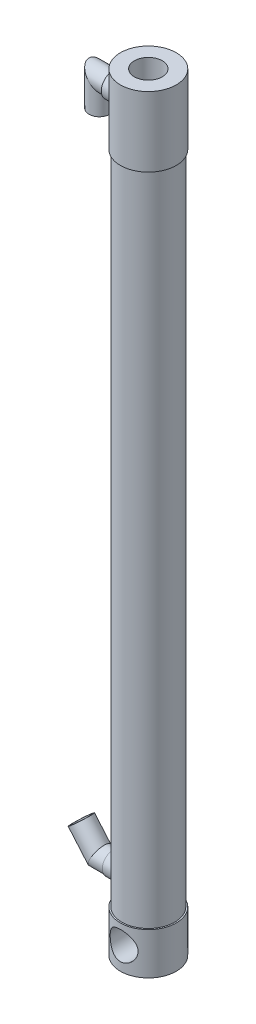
ISO-10303-21;
HEADER;
FILE_DESCRIPTION(('STEP AP214'),'2;1');
FILE_NAME('part.step','',(''),(''),'','','');
FILE_SCHEMA(('AUTOMOTIVE_DESIGN { 1 0 10303 214 1 1 1 1 }'));
ENDSEC;
DATA;
#1=APPLICATION_CONTEXT('core data for automotive mechanical design processes');
#2=APPLICATION_PROTOCOL_DEFINITION('international standard','automotive_design',2000,#1);
#3=PRODUCT_CONTEXT('',#1,'mechanical');
#4=PRODUCT('Part','Part','',(#3));
#5=PRODUCT_RELATED_PRODUCT_CATEGORY('part','',(#4));
#6=PRODUCT_DEFINITION_FORMATION('','',#4);
#7=PRODUCT_DEFINITION_CONTEXT('part definition',#1,'design');
#8=PRODUCT_DEFINITION('design','',#6,#7);
#9=PRODUCT_DEFINITION_SHAPE('','',#8);
#10=(LENGTH_UNIT() NAMED_UNIT(*) SI_UNIT(.MILLI.,.METRE.));
#11=(NAMED_UNIT(*) PLANE_ANGLE_UNIT() SI_UNIT($,.RADIAN.));
#12=(NAMED_UNIT(*) SI_UNIT($,.STERADIAN.) SOLID_ANGLE_UNIT());
#13=UNCERTAINTY_MEASURE_WITH_UNIT(LENGTH_MEASURE(1.E-05),#10,'distance_accuracy_value','');
#14=(GEOMETRIC_REPRESENTATION_CONTEXT(3) GLOBAL_UNCERTAINTY_ASSIGNED_CONTEXT((#13)) GLOBAL_UNIT_ASSIGNED_CONTEXT((#10,
#11,#12)) REPRESENTATION_CONTEXT('',''));
#15=CARTESIAN_POINT('',(0.,0.,0.));
#16=DIRECTION('',(0.,0.,1.));
#17=DIRECTION('',(1.,0.,0.));
#18=AXIS2_PLACEMENT_3D('',#15,#16,#17);
#19=CARTESIAN_POINT('',(0.,0.,0.));
#20=DIRECTION('',(0.,-1.,0.));
#21=DIRECTION('',(0.,0.,-1.));
#22=AXIS2_PLACEMENT_3D('',#19,#20,#21);
#23=CYLINDRICAL_SURFACE('',#22,19.);
#24=CARTESIAN_POINT('',(-17.233687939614,15.,-7.99999999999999));
#25=CARTESIAN_POINT('',(-17.2336895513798,15.2132080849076,-7.99999846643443));
#26=CARTESIAN_POINT('',(-17.2376582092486,15.4264892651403,-7.99146433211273));
#27=CARTESIAN_POINT('',(-17.2534021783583,15.8514961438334,-7.95741504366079));
#28=CARTESIAN_POINT('',(-17.265182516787,16.0632207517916,-7.93188895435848));
#29=CARTESIAN_POINT('',(-17.2961790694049,16.4838785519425,-7.86406892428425));
#30=CARTESIAN_POINT('',(-17.3154109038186,16.6928049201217,-7.82173975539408));
#31=CARTESIAN_POINT('',(-17.3606746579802,17.1059988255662,-7.72075329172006));
#32=CARTESIAN_POINT('',(-17.3867094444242,17.3102643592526,-7.66208911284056));
#33=CARTESIAN_POINT('',(-17.4446147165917,17.7118013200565,-7.5293182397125));
#34=CARTESIAN_POINT('',(-17.4764578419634,17.909100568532,-7.45528373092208));
#35=CARTESIAN_POINT('',(-17.5451095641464,18.2965568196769,-7.29225221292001));
#36=CARTESIAN_POINT('',(-17.5819200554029,18.4867110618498,-7.20324949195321));
#37=CARTESIAN_POINT('',(-17.6982104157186,19.0445807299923,-6.91493656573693));
#38=CARTESIAN_POINT('',(-17.7836256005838,19.4002040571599,-6.694154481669));
#39=CARTESIAN_POINT('',(-17.9666593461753,20.0910161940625,-6.18673515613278));
#40=CARTESIAN_POINT('',(-18.0646975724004,20.4238445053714,-5.89703479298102));
#41=CARTESIAN_POINT('',(-18.209959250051,20.8842017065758,-5.42445418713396));
#42=CARTESIAN_POINT('',(-18.2581135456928,21.0312623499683,-5.26046108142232));
#43=CARTESIAN_POINT('',(-18.3526172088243,21.3115738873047,-4.9206190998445));
#44=CARTESIAN_POINT('',(-18.3989672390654,21.4448298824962,-4.74477464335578));
#45=CARTESIAN_POINT('',(-18.4907073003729,21.702341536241,-4.37399629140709));
#46=CARTESIAN_POINT('',(-18.5359602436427,21.8259222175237,-4.17855943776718));
#47=CARTESIAN_POINT('',(-18.6219257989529,22.0560263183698,-3.77703638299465));
#48=CARTESIAN_POINT('',(-18.6626402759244,22.162556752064,-3.57095460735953));
#49=CARTESIAN_POINT('',(-18.738375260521,22.3576348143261,-3.1494647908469));
#50=CARTESIAN_POINT('',(-18.7733964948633,22.4461847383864,-2.93405794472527));
#51=CARTESIAN_POINT('',(-18.8367127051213,22.604407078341,-2.49546192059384));
#52=CARTESIAN_POINT('',(-18.8650081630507,22.6740808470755,-2.27227330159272));
#53=CARTESIAN_POINT('',(-18.9127127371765,22.7905951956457,-1.8318646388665));
#54=CARTESIAN_POINT('',(-18.932513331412,22.8384501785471,-1.61495514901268));
#55=CARTESIAN_POINT('',(-18.9647544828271,22.9160065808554,-1.17737223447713));
#56=CARTESIAN_POINT('',(-18.9771952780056,22.9457085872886,-0.956698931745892));
#57=CARTESIAN_POINT('',(-18.9943564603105,22.9866089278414,-0.513423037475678));
#58=CARTESIAN_POINT('',(-18.9990795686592,22.9978137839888,-0.290821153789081));
#59=CARTESIAN_POINT('',(-19.0006761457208,23.0016060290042,0.154565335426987));
#60=CARTESIAN_POINT('',(-18.997549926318,22.994194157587,0.377349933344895));
#61=CARTESIAN_POINT('',(-18.9839788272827,22.961887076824,0.807413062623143));
#62=CARTESIAN_POINT('',(-18.9740028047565,22.9381116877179,1.01479170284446));
#63=CARTESIAN_POINT('',(-18.9474821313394,22.8745104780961,1.42672017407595));
#64=CARTESIAN_POINT('',(-18.9309352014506,22.834679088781,1.63126899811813));
#65=CARTESIAN_POINT('',(-18.8916915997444,22.7393729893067,2.03600544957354));
#66=CARTESIAN_POINT('',(-18.8689970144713,22.6839035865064,2.23619453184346));
#67=CARTESIAN_POINT('',(-18.8179983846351,22.557803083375,2.63108168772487));
#68=CARTESIAN_POINT('',(-18.7896922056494,22.4871662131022,2.82577763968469));
#69=CARTESIAN_POINT('',(-18.7276878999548,22.3301821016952,3.21129105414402));
#70=CARTESIAN_POINT('',(-18.6939158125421,22.2436167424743,3.40200770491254));
#71=CARTESIAN_POINT('',(-18.6220791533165,22.0561552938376,3.77549323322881));
#72=CARTESIAN_POINT('',(-18.584013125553,21.9552543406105,3.95825938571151));
#73=CARTESIAN_POINT('',(-18.5044745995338,21.73985141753,4.31483424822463));
#74=CARTESIAN_POINT('',(-18.4630017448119,21.6253480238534,4.48864201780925));
#75=CARTESIAN_POINT('',(-18.3775940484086,21.383475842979,4.82642650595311));
#76=CARTESIAN_POINT('',(-18.3336590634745,21.2561063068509,4.99040265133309));
#77=CARTESIAN_POINT('',(-18.2410999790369,20.979623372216,5.31916288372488));
#78=CARTESIAN_POINT('',(-18.1923659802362,20.8296047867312,5.48315567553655));
#79=CARTESIAN_POINT('',(-18.0944873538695,20.5165718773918,5.79799121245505));
#80=CARTESIAN_POINT('',(-18.045342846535,20.3535612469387,5.94883766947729));
#81=CARTESIAN_POINT('',(-17.9478918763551,20.0152837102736,6.23668875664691));
#82=CARTESIAN_POINT('',(-17.899586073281,19.8400076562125,6.37368286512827));
#83=CARTESIAN_POINT('',(-17.805194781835,19.4783278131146,6.63280105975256));
#84=CARTESIAN_POINT('',(-17.7591084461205,19.2919283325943,6.75493084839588));
#85=CARTESIAN_POINT('',(-17.6689219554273,18.9023000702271,6.98750999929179));
#86=CARTESIAN_POINT('',(-17.6249463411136,18.698711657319,7.0974064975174));
#87=CARTESIAN_POINT('',(-17.5422296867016,18.281995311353,7.29945879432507));
#88=CARTESIAN_POINT('',(-17.5034863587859,18.0688716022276,7.39162235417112));
#89=CARTESIAN_POINT('',(-17.4325797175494,17.6345232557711,7.55733369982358));
#90=CARTESIAN_POINT('',(-17.4004140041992,17.4133016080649,7.63088827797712));
#91=CARTESIAN_POINT('',(-17.3438504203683,16.9643587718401,7.75859155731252));
#92=CARTESIAN_POINT('',(-17.3194518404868,16.7366381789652,7.81274203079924));
#93=CARTESIAN_POINT('',(-17.2807048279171,16.2917389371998,7.89805582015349));
#94=CARTESIAN_POINT('',(-17.265800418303,16.0748534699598,7.93049796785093));
#95=CARTESIAN_POINT('',(-17.2441463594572,15.6387470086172,7.97747403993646));
#96=CARTESIAN_POINT('',(-17.2373963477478,15.4195261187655,7.99200876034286));
#97=CARTESIAN_POINT('',(-17.2323019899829,14.9806032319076,8.00298722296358));
#98=CARTESIAN_POINT('',(-17.2339550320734,14.7609014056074,7.99943658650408));
#99=CARTESIAN_POINT('',(-17.245599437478,14.3227600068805,7.97430197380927));
#100=CARTESIAN_POINT('',(-17.2555905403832,14.1043203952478,7.95271856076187));
#101=CARTESIAN_POINT('',(-17.2826136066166,13.6848542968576,7.89380980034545));
#102=CARTESIAN_POINT('',(-17.2991348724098,13.483633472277,7.8576229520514));
#103=CARTESIAN_POINT('',(-17.3386145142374,13.0850865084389,7.77011896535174));
#104=CARTESIAN_POINT('',(-17.3615751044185,12.8877617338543,7.71879662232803));
#105=CARTESIAN_POINT('',(-17.4132458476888,12.4983275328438,7.60151106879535));
#106=CARTESIAN_POINT('',(-17.4419548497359,12.306217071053,7.53555078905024));
#107=CARTESIAN_POINT('',(-17.504313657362,11.9282228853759,7.38953940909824));
#108=CARTESIAN_POINT('',(-17.5379653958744,11.7423416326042,7.30948279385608));
#109=CARTESIAN_POINT('',(-17.6480310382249,11.1801176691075,7.0416881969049));
#110=CARTESIAN_POINT('',(-17.7312706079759,10.8156359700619,6.83126373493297));
#111=CARTESIAN_POINT('',(-17.9066883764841,10.1254390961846,6.35721150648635));
#112=CARTESIAN_POINT('',(-17.9988704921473,9.79974104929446,6.0935603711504));
#113=CARTESIAN_POINT('',(-18.1410254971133,9.33243599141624,5.65066555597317));
#114=CARTESIAN_POINT('',(-18.1910061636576,9.17480136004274,5.488021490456));
#115=CARTESIAN_POINT('',(-18.2896428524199,8.87372372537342,5.14975306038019));
#116=CARTESIAN_POINT('',(-18.3382993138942,8.73027597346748,4.97413307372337));
#117=CARTESIAN_POINT('',(-18.4330079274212,8.45843852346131,4.61080113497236));
#118=CARTESIAN_POINT('',(-18.47905872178,8.33005663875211,4.42308298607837));
#119=CARTESIAN_POINT('',(-18.5672669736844,8.08943352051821,4.03680782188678));
#120=CARTESIAN_POINT('',(-18.609426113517,7.97718530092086,3.83825554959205));
#121=CARTESIAN_POINT('',(-18.6888570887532,7.76932635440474,3.43072448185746));
#122=CARTESIAN_POINT('',(-18.7261103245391,7.67377851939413,3.22170993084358));
#123=CARTESIAN_POINT('',(-18.79448363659,7.5007376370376,2.79535154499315));
#124=CARTESIAN_POINT('',(-18.8256036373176,7.42324481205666,2.5780076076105));
#125=CARTESIAN_POINT('',(-18.8807801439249,7.28717122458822,2.13671637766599));
#126=CARTESIAN_POINT('',(-18.9048401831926,7.22858100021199,1.91277245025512));
#127=CARTESIAN_POINT('',(-18.9451867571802,7.1309414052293,1.45998022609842));
#128=CARTESIAN_POINT('',(-18.9614738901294,7.0918905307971,1.23113230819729));
#129=CARTESIAN_POINT('',(-18.9849078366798,7.0358729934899,0.786881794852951));
#130=CARTESIAN_POINT('',(-18.9926226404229,7.01753246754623,0.571681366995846));
#131=CARTESIAN_POINT('',(-19.0007055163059,6.99831962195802,0.1403688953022));
#132=CARTESIAN_POINT('',(-19.0010739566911,6.99744642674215,-0.0757431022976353));
#133=CARTESIAN_POINT('',(-18.9944547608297,7.01317577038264,-0.507178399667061));
#134=CARTESIAN_POINT('',(-18.9874683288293,7.029775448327,-0.722501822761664));
#135=CARTESIAN_POINT('',(-18.9663314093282,7.08026185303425,-1.15075348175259));
#136=CARTESIAN_POINT('',(-18.9521809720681,7.11414845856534,-1.36368173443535));
#137=CARTESIAN_POINT('',(-18.917747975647,7.19727222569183,-1.77774185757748));
#138=CARTESIAN_POINT('',(-18.897712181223,7.24589377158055,-1.97901841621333));
#139=CARTESIAN_POINT('',(-18.8518321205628,7.3583894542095,-2.37665661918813));
#140=CARTESIAN_POINT('',(-18.8259858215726,7.42226892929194,-2.57301651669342));
#141=CARTESIAN_POINT('',(-18.7691095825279,7.56469678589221,-2.95950565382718));
#142=CARTESIAN_POINT('',(-18.7380808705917,7.64324169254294,-3.14963635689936));
#143=CARTESIAN_POINT('',(-18.6715401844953,7.81441504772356,-3.52271349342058));
#144=CARTESIAN_POINT('',(-18.6360265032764,7.90704886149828,-3.70565715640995));
#145=CARTESIAN_POINT('',(-18.5596411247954,8.11018648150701,-4.07138452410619));
#146=CARTESIAN_POINT('',(-18.5186002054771,8.22130697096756,-4.25379036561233));
#147=CARTESIAN_POINT('',(-18.4334767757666,8.45743208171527,-4.60871530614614));
#148=CARTESIAN_POINT('',(-18.3893932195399,8.58244148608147,-4.78123096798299));
#149=CARTESIAN_POINT('',(-18.2992355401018,8.84554673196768,-5.11546139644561));
#150=CARTESIAN_POINT('',(-18.2531611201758,8.98364452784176,-5.27717454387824));
#151=CARTESIAN_POINT('',(-18.1601177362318,9.27212807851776,-5.58897118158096));
#152=CARTESIAN_POINT('',(-18.1131487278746,9.42251444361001,-5.73905409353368));
#153=CARTESIAN_POINT('',(-18.0161600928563,9.74572374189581,-6.03690261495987));
#154=CARTESIAN_POINT('',(-17.9661570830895,9.91938034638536,-6.18377052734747));
#155=CARTESIAN_POINT('',(-17.8678431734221,10.2788048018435,-6.46235242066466));
#156=CARTESIAN_POINT('',(-17.8195317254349,10.4645686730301,-6.59407134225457));
#157=CARTESIAN_POINT('',(-17.7259569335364,10.8474071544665,-6.84163615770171));
#158=CARTESIAN_POINT('',(-17.6806967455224,11.0444930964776,-6.95746574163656));
#159=CARTESIAN_POINT('',(-17.5947111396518,11.4485500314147,-7.17213434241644));
#160=CARTESIAN_POINT('',(-17.5539836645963,11.6555164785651,-7.27098107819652));
#161=CARTESIAN_POINT('',(-17.4785304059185,12.0773436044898,-7.45053236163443));
#162=CARTESIAN_POINT('',(-17.4437836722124,12.2921733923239,-7.53130054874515));
#163=CARTESIAN_POINT('',(-17.3813579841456,12.7288215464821,-7.67427437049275));
#164=CARTESIAN_POINT('',(-17.3536755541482,12.9506364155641,-7.73648913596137));
#165=CARTESIAN_POINT('',(-17.3064593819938,13.3990274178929,-7.84154174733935));
#166=CARTESIAN_POINT('',(-17.2869041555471,13.6255893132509,-7.88443070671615));
#167=CARTESIAN_POINT('',(-17.2566190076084,14.0820336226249,-7.9504992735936));
#168=CARTESIAN_POINT('',(-17.2458822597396,14.311913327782,-7.97369412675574));
#169=CARTESIAN_POINT('',(-17.2377396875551,14.6185652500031,-7.99126648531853));
#170=CARTESIAN_POINT('',(-17.2362213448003,14.694803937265,-7.99454057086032));
#171=CARTESIAN_POINT('',(-17.234195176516,14.8473586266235,-7.99890761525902));
#172=CARTESIAN_POINT('',(-17.2336873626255,14.9236746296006,-8.000000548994));
#173=CARTESIAN_POINT('',(-17.233687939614,15.,-7.99999999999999));
#174=B_SPLINE_CURVE_WITH_KNOTS('',3,(#24,#25,#26,#27,#28,#29,#30,#31,#32,#33,#34,#35,#36,#37,
#38,#39,#40,#41,#42,#43,#44,#45,#46,#47,#48,#49,#50,#51,#52,#53,#54,#55,#56,#57,#58,#59,#60,#61,
#62,#63,#64,#65,#66,#67,#68,#69,#70,#71,#72,#73,#74,#75,#76,#77,#78,#79,#80,#81,#82,#83,#84,#85,
#86,#87,#88,#89,#90,#91,#92,#93,#94,#95,#96,#97,#98,#99,#100,#101,#102,#103,#104,#105,#106,#107,
#108,#109,#110,#111,#112,#113,#114,#115,#116,#117,#118,#119,#120,#121,#122,#123,#124,#125,#126,
#127,#128,#129,#130,#131,#132,#133,#134,#135,#136,#137,#138,#139,#140,#141,#142,#143,#144,#145,
#146,#147,#148,#149,#150,#151,#152,#153,#154,#155,#156,#157,#158,#159,#160,#161,#162,#163,#164,
#165,#166,#167,#168,#169,#170,#171,#172,#173),.UNSPECIFIED.,.T.,.F.,(4,2,2,2,2,2,2,2,2,2,2,2,2,
2,2,2,2,2,2,2,2,2,2,2,2,2,2,2,2,2,2,2,2,2,2,2,2,2,2,2,2,2,2,2,2,2,2,2,2,2,2,2,2,2,2,2,2,2,2,2,2,
2,2,2,2,2,2,2,2,2,2,2,2,2,4),(0.,0.639544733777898,1.27950144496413,1.92080698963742,
2.56238321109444,3.20101185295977,3.839884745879,5.11604829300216,6.46579360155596,
7.14161122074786,7.81717820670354,8.52314952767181,9.22882967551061,9.93441967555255,
10.6399590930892,11.3081068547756,11.9762330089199,12.644123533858,13.3119875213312,
13.9381767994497,14.5645834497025,15.1907777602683,15.8172107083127,16.452964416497,
17.0889343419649,17.7249708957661,18.3610444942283,19.0428990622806,19.7245604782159,
20.4067358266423,21.088648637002,21.7942406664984,22.4995231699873,23.2045478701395,
23.9095081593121,24.5680496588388,25.2265618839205,25.8848694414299,26.5431564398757,
27.1578013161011,27.7726577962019,28.3873912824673,29.0023658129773,30.2836842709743,
31.5655665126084,32.2607245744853,32.9556491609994,33.6509325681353,34.3459139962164,
35.0434587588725,35.7410121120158,36.4382157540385,37.1353657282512,37.7829025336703,
38.4304068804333,39.0778052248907,39.7251990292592,40.348593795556,40.9722069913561,
41.5956726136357,42.2193762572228,42.8711542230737,43.5231573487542,44.175257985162,
44.8273910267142,45.5251756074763,46.2227319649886,46.9209990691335,47.6189479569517,
48.3143998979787,49.0095090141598,49.7027687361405,50.3954912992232,50.6244363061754,
50.8533839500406),.UNSPECIFIED.);
#175=CARTESIAN_POINT('',(-17.233687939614,15.,-7.99999999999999));
#176=VERTEX_POINT('',#175);
#177=EDGE_CURVE('E49',#176,#176,#174,.T.);
#178=ORIENTED_EDGE('',*,*,#177,.T.);
#179=EDGE_LOOP('',(#178));
#180=FACE_BOUND('',#179,.T.);
#181=CARTESIAN_POINT('',(0.,0.,0.));
#182=DIRECTION('',(0.,-1.,0.));
#183=DIRECTION('',(0.,0.,-1.));
#184=AXIS2_PLACEMENT_3D('',#181,#182,#183);
#185=CIRCLE('',#184,19.);
#186=CARTESIAN_POINT('',(0.,0.,-19.));
#187=VERTEX_POINT('',#186);
#188=EDGE_CURVE('E189',#187,#187,#185,.T.);
#189=ORIENTED_EDGE('',*,*,#188,.F.);
#190=EDGE_LOOP('',(#189));
#191=FACE_BOUND('',#190,.T.);
#192=CARTESIAN_POINT('',(0.,470.,0.));
#193=DIRECTION('',(0.,1.,0.));
#194=DIRECTION('',(0.,0.,1.));
#195=AXIS2_PLACEMENT_3D('',#192,#193,#194);
#196=CIRCLE('',#195,19.);
#197=CARTESIAN_POINT('',(0.,470.,19.));
#198=VERTEX_POINT('',#197);
#199=EDGE_CURVE('E192',#198,#198,#196,.T.);
#200=ORIENTED_EDGE('',*,*,#199,.F.);
#201=EDGE_LOOP('',(#200));
#202=FACE_BOUND('',#201,.T.);
#203=ADVANCED_FACE('F26',(#180,#191,#202),#23,.T.);
#204=CARTESIAN_POINT('',(0.,0.,0.));
#205=DIRECTION('',(0.,-1.,0.));
#206=DIRECTION('',(0.,0.,-1.));
#207=AXIS2_PLACEMENT_3D('',#204,#205,#206);
#208=PLANE('',#207);
#209=CARTESIAN_POINT('',(0.,0.,0.));
#210=DIRECTION('',(0.,-1.,0.));
#211=DIRECTION('',(0.,0.,-1.));
#212=AXIS2_PLACEMENT_3D('',#209,#210,#211);
#213=CIRCLE('',#212,20.);
#214=CARTESIAN_POINT('',(0.,0.,-20.));
#215=VERTEX_POINT('',#214);
#216=EDGE_CURVE('E150',#215,#215,#213,.T.);
#217=ORIENTED_EDGE('',*,*,#216,.F.);
#218=EDGE_LOOP('',(#217));
#219=FACE_BOUND('',#218,.T.);
#220=ORIENTED_EDGE('',*,*,#188,.T.);
#221=EDGE_LOOP('',(#220));
#222=FACE_BOUND('',#221,.T.);
#223=ADVANCED_FACE('F135',(#219,#222),#208,.F.);
#224=CARTESIAN_POINT('',(0.,-30.,0.));
#225=DIRECTION('',(0.,1.,0.));
#226=DIRECTION('',(0.,0.,1.));
#227=AXIS2_PLACEMENT_3D('',#224,#225,#226);
#228=CYLINDRICAL_SURFACE('',#227,20.);
#229=CARTESIAN_POINT('',(0.,-24.,20.));
#230=CARTESIAN_POINT('',(-0.26297774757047,-23.9999991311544,19.9999992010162));
#231=CARTESIAN_POINT('',(-0.525973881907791,-23.9896144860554,19.9948010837));
#232=CARTESIAN_POINT('',(-1.05002923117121,-23.9481941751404,19.9741395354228));
#233=CARTESIAN_POINT('',(-1.31108755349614,-23.9171495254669,19.9586716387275));
#234=CARTESIAN_POINT('',(-1.82963226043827,-23.8347080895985,19.9178362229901));
#235=CARTESIAN_POINT('',(-2.08711188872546,-23.7832771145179,19.8924520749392));
#236=CARTESIAN_POINT('',(-2.59618182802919,-23.6606617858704,19.8324363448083));
#237=CARTESIAN_POINT('',(-2.84777272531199,-23.5894794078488,19.7978056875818));
#238=CARTESIAN_POINT('',(-3.34246836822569,-23.4284309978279,19.720303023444));
#239=CARTESIAN_POINT('',(-3.58560245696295,-23.3386391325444,19.6774637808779));
#240=CARTESIAN_POINT('',(-4.06298432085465,-23.1410556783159,19.5844658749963));
#241=CARTESIAN_POINT('',(-4.29723190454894,-23.0332637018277,19.5343070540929));
#242=CARTESIAN_POINT('',(-4.75551398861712,-22.8006307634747,19.4278257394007));
#243=CARTESIAN_POINT('',(-4.97955221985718,-22.6757960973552,19.371505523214));
#244=CARTESIAN_POINT('',(-5.41653080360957,-22.4099130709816,19.2538936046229));
#245=CARTESIAN_POINT('',(-5.62946673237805,-22.2688583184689,19.1925999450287));
#246=CARTESIAN_POINT('',(-6.05571153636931,-21.9624954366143,19.0625536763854));
#247=CARTESIAN_POINT('',(-6.2682689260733,-21.7962377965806,18.9935741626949));
#248=CARTESIAN_POINT('',(-6.67880739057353,-21.4475548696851,18.8531326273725));
#249=CARTESIAN_POINT('',(-6.87678763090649,-21.265128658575,18.7816704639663));
#250=CARTESIAN_POINT('',(-7.25738906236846,-20.8849614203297,18.6379106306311));
#251=CARTESIAN_POINT('',(-7.44000060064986,-20.6872109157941,18.5656124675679));
#252=CARTESIAN_POINT('',(-7.78888361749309,-20.2773980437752,18.4219676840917));
#253=CARTESIAN_POINT('',(-7.95515202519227,-20.0653329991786,18.3506212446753));
#254=CARTESIAN_POINT('',(-8.2827111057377,-19.6108068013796,18.2052535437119));
#255=CARTESIAN_POINT('',(-8.44260565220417,-19.3672646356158,18.1314567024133));
#256=CARTESIAN_POINT('',(-8.74109142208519,-18.8660415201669,17.9894590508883));
#257=CARTESIAN_POINT('',(-8.87969167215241,-18.6083666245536,17.9212558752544));
#258=CARTESIAN_POINT('',(-9.13438777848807,-18.0803007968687,17.7927881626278));
#259=CARTESIAN_POINT('',(-9.25049044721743,-17.8099137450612,17.7325212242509));
#260=CARTESIAN_POINT('',(-9.45894522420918,-17.25811404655,17.6222099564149));
#261=CARTESIAN_POINT('',(-9.55129996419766,-16.9767026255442,17.5721644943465));
#262=CARTESIAN_POINT('',(-9.70625458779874,-16.4220849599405,17.4870229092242));
#263=CARTESIAN_POINT('',(-9.77030307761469,-16.14939374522,17.4512120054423));
#264=CARTESIAN_POINT('',(-9.87543221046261,-15.5982835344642,17.3919377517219));
#265=CARTESIAN_POINT('',(-9.91651383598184,-15.3198647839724,17.368473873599));
#266=CARTESIAN_POINT('',(-9.97504777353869,-14.7599854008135,17.3349233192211));
#267=CARTESIAN_POINT('',(-9.99252007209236,-14.478527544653,17.3248253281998));
#268=CARTESIAN_POINT('',(-10.0036080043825,-13.914997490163,17.3184259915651));
#269=CARTESIAN_POINT('',(-9.99722591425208,-13.6329253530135,17.3221233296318));
#270=CARTESIAN_POINT('',(-9.96291632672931,-13.1045952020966,17.3418743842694));
#271=CARTESIAN_POINT('',(-9.93766509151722,-12.8580998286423,17.3563927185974));
#272=CARTESIAN_POINT('',(-9.8690882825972,-12.3683607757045,17.3954780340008));
#273=CARTESIAN_POINT('',(-9.82575672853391,-12.1251181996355,17.4200483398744));
#274=CARTESIAN_POINT('',(-9.72152759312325,-11.6436082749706,17.4784283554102));
#275=CARTESIAN_POINT('',(-9.66063238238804,-11.4053402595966,17.5122368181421));
#276=CARTESIAN_POINT('',(-9.52187989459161,-10.9350464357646,17.5880654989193));
#277=CARTESIAN_POINT('',(-9.44401584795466,-10.7030231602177,17.6300889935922));
#278=CARTESIAN_POINT('',(-9.27007793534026,-10.2412894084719,17.7221768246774));
#279=CARTESIAN_POINT('',(-9.17362860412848,-10.0117529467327,17.7724029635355));
#280=CARTESIAN_POINT('',(-8.96447979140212,-9.56156183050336,17.878810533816));
#281=CARTESIAN_POINT('',(-8.85177491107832,-9.34091015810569,17.9349939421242));
#282=CARTESIAN_POINT('',(-8.61087933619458,-8.90943822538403,18.0518884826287));
#283=CARTESIAN_POINT('',(-8.4826858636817,-8.69861973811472,18.1126004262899));
#284=CARTESIAN_POINT('',(-8.21155546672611,-8.28764763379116,18.2371218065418));
#285=CARTESIAN_POINT('',(-8.06861764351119,-8.0874946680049,18.3009314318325));
#286=CARTESIAN_POINT('',(-7.74962298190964,-7.67386832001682,18.4384710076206));
#287=CARTESIAN_POINT('',(-7.57166567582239,-7.46193389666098,18.5124312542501));
#288=CARTESIAN_POINT('',(-7.19890817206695,-7.05362513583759,18.6605447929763));
#289=CARTESIAN_POINT('',(-7.00411219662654,-6.85724692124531,18.7346980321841));
#290=CARTESIAN_POINT('',(-6.5984132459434,-6.48085341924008,18.8814062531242));
#291=CARTESIAN_POINT('',(-6.38749704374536,-6.30085184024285,18.9539598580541));
#292=CARTESIAN_POINT('',(-5.9507961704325,-5.95854713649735,19.0955673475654));
#293=CARTESIAN_POINT('',(-5.72501741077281,-5.79623704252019,19.164622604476));
#294=CARTESIAN_POINT('',(-5.24872768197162,-5.48320413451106,19.3006480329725));
#295=CARTESIAN_POINT('',(-4.99755374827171,-5.33337915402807,19.3673693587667));
#296=CARTESIAN_POINT('',(-4.48152997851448,-5.05563076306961,19.4932401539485));
#297=CARTESIAN_POINT('',(-4.21667950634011,-4.92770837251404,19.5523892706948));
#298=CARTESIAN_POINT('',(-3.67526022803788,-4.69520569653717,19.6613492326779));
#299=CARTESIAN_POINT('',(-3.39869900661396,-4.59061056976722,19.7111660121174));
#300=CARTESIAN_POINT('',(-2.83582264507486,-4.40594922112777,19.7999810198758));
#301=CARTESIAN_POINT('',(-2.54950863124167,-4.3258801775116,19.8389804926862));
#302=CARTESIAN_POINT('',(-1.99360082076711,-4.19693413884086,19.9021913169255));
#303=CARTESIAN_POINT('',(-1.72458658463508,-4.14602275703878,19.9273600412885));
#304=CARTESIAN_POINT('',(-1.18250594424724,-4.06638484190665,19.9668602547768));
#305=CARTESIAN_POINT('',(-0.909439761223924,-4.03765710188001,19.9811923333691));
#306=CARTESIAN_POINT('',(-0.361621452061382,-4.00277367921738,19.9986076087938));
#307=CARTESIAN_POINT('',(-0.0868700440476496,-3.9966089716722,20.0016953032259));
#308=CARTESIAN_POINT('',(0.462095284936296,-4.0069111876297,19.996544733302));
#309=CARTESIAN_POINT('',(0.736309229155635,-4.02337710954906,19.9883069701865));
#310=CARTESIAN_POINT('',(1.26069578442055,-4.07656206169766,19.9618171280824));
#311=CARTESIAN_POINT('',(1.51108216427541,-4.11160957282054,19.9443921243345));
#312=CARTESIAN_POINT('',(2.00770334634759,-4.20036999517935,19.9005341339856));
#313=CARTESIAN_POINT('',(2.25393841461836,-4.25408170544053,19.8741017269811));
#314=CARTESIAN_POINT('',(2.7406844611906,-4.3796139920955,19.812845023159));
#315=CARTESIAN_POINT('',(2.98119512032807,-4.45143557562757,19.7780202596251));
#316=CARTESIAN_POINT('',(3.4550508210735,-4.61249465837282,19.7007681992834));
#317=CARTESIAN_POINT('',(3.68839556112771,-4.70173288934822,19.6583405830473));
#318=CARTESIAN_POINT('',(4.15316088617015,-4.8996247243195,19.5655046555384));
#319=CARTESIAN_POINT('',(4.38433936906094,-5.00875703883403,19.5149041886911));
#320=CARTESIAN_POINT('',(4.83663774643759,-5.24374789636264,19.4077573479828));
#321=CARTESIAN_POINT('',(5.05775400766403,-5.36961241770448,19.3512088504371));
#322=CARTESIAN_POINT('',(5.70436813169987,-5.77094348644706,19.1744474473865));
#323=CARTESIAN_POINT('',(6.11337858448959,-6.07025366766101,19.0470672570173));
#324=CARTESIAN_POINT('',(6.91779518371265,-6.75770054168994,18.7707873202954));
#325=CARTESIAN_POINT('',(7.30792110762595,-7.15167370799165,18.6210027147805));
#326=CARTESIAN_POINT('',(7.84082560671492,-7.78726055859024,18.3999640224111));
#327=CARTESIAN_POINT('',(8.00984942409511,-8.00673521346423,18.3268393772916));
#328=CARTESIAN_POINT('',(8.32960568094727,-8.45973944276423,18.183737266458));
#329=CARTESIAN_POINT('',(8.4803354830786,-8.69327103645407,18.1137602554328));
#330=CARTESIAN_POINT('',(8.76928163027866,-9.18492599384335,17.9757225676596));
#331=CARTESIAN_POINT('',(8.90652817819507,-9.44369330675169,17.9079221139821));
#332=CARTESIAN_POINT('',(9.15837639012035,-9.97381154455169,17.7804404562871));
#333=CARTESIAN_POINT('',(9.27298894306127,-10.2451563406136,17.7207553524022));
#334=CARTESIAN_POINT('',(9.47827705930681,-10.7985498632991,17.6118078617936));
#335=CARTESIAN_POINT('',(9.56897185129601,-11.0805897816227,17.5625371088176));
#336=CARTESIAN_POINT('',(9.72530086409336,-11.6533832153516,17.4764560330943));
#337=CARTESIAN_POINT('',(9.79093896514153,-11.9441353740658,17.4396437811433));
#338=CARTESIAN_POINT('',(9.89107565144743,-12.5035247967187,17.3830260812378));
#339=CARTESIAN_POINT('',(9.92795857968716,-12.7716057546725,17.3619273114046));
#340=CARTESIAN_POINT('',(9.97987692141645,-13.3105606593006,17.332136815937));
#341=CARTESIAN_POINT('',(9.99491382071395,-13.5814344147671,17.3234442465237));
#342=CARTESIAN_POINT('',(10.0029096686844,-14.1235135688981,17.3188284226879));
#343=CARTESIAN_POINT('',(9.9958767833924,-14.39471880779,17.3229004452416));
#344=CARTESIAN_POINT('',(9.95985898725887,-14.9351721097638,17.3436339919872));
#345=CARTESIAN_POINT('',(9.93087497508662,-15.2044202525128,17.3602950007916));
#346=CARTESIAN_POINT('',(9.85519722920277,-15.7131144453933,17.4033551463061));
#347=CARTESIAN_POINT('',(9.81046230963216,-15.952948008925,17.4286705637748));
#348=CARTESIAN_POINT('',(9.70388285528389,-16.4277291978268,17.4882355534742));
#349=CARTESIAN_POINT('',(9.64203265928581,-16.6626751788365,17.5224880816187));
#350=CARTESIAN_POINT('',(9.50186064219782,-17.126223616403,17.5988921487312));
#351=CARTESIAN_POINT('',(9.42354151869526,-17.3548271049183,17.6410423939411));
#352=CARTESIAN_POINT('',(9.25107208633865,-17.8046984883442,17.7320944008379));
#353=CARTESIAN_POINT('',(9.15691467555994,-18.0259630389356,17.7809991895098));
#354=CARTESIAN_POINT('',(8.94668289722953,-18.4746258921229,17.8877520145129));
#355=CARTESIAN_POINT('',(8.82956366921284,-18.7014441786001,17.9459794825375));
#356=CARTESIAN_POINT('',(8.57895403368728,-19.144545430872,18.067122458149));
#357=CARTESIAN_POINT('',(8.44546216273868,-19.3608274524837,18.130038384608));
#358=CARTESIAN_POINT('',(8.16285657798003,-19.7820513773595,18.2590224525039));
#359=CARTESIAN_POINT('',(8.0137373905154,-19.9869892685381,18.3250916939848));
#360=CARTESIAN_POINT('',(7.70065351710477,-20.3846685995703,18.4588439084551));
#361=CARTESIAN_POINT('',(7.53668670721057,-20.5774082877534,18.5265271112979));
#362=CARTESIAN_POINT('',(7.17380336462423,-20.9725890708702,18.6702735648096));
#363=CARTESIAN_POINT('',(6.97306234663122,-21.1733531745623,18.746353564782));
#364=CARTESIAN_POINT('',(6.55492133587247,-21.557351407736,18.8966226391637));
#365=CARTESIAN_POINT('',(6.33752607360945,-21.7405904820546,18.9708122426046));
#366=CARTESIAN_POINT('',(5.88693376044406,-22.0885782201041,19.1154396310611));
#367=CARTESIAN_POINT('',(5.65372458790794,-22.2533124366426,19.1858744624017));
#368=CARTESIAN_POINT('',(5.1728954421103,-22.5628791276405,19.3210638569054));
#369=CARTESIAN_POINT('',(4.92527630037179,-22.70771274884,19.3858187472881));
#370=CARTESIAN_POINT('',(4.41518835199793,-22.9771882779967,19.5083417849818));
#371=CARTESIAN_POINT('',(4.15262447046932,-23.101675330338,19.5660555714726));
#372=CARTESIAN_POINT('',(3.61607511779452,-23.3278473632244,19.6722841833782));
#373=CARTESIAN_POINT('',(3.34209105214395,-23.4295351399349,19.7208001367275));
#374=CARTESIAN_POINT('',(2.78539452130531,-23.6086874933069,19.8070877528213));
#375=CARTESIAN_POINT('',(2.50270444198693,-23.6862092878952,19.8448847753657));
#376=CARTESIAN_POINT('',(1.93047321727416,-23.8162760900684,19.908692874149));
#377=CARTESIAN_POINT('',(1.64093637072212,-23.8688363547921,19.9347111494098));
#378=CARTESIAN_POINT('',(1.12608352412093,-23.9389489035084,19.9695276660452));
#379=CARTESIAN_POINT('',(0.901651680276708,-23.961823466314,19.9809348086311));
#380=CARTESIAN_POINT('',(0.451484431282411,-23.9923495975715,19.9961714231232));
#381=CARTESIAN_POINT('',(0.225748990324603,-24.0000007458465,20.0000006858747));
#382=CARTESIAN_POINT('',(0.,-24.,20.));
#383=B_SPLINE_CURVE_WITH_KNOTS('',3,(#229,#230,#231,#232,#233,#234,#235,#236,#237,#238,#239,
#240,#241,#242,#243,#244,#245,#246,#247,#248,#249,#250,#251,#252,#253,#254,#255,#256,#257,#258,
#259,#260,#261,#262,#263,#264,#265,#266,#267,#268,#269,#270,#271,#272,#273,#274,#275,#276,#277,
#278,#279,#280,#281,#282,#283,#284,#285,#286,#287,#288,#289,#290,#291,#292,#293,#294,#295,#296,
#297,#298,#299,#300,#301,#302,#303,#304,#305,#306,#307,#308,#309,#310,#311,#312,#313,#314,#315,
#316,#317,#318,#319,#320,#321,#322,#323,#324,#325,#326,#327,#328,#329,#330,#331,#332,#333,#334,
#335,#336,#337,#338,#339,#340,#341,#342,#343,#344,#345,#346,#347,#348,#349,#350,#351,#352,#353,
#354,#355,#356,#357,#358,#359,#360,#361,#362,#363,#364,#365,#366,#367,#368,#369,#370,#371,#372,
#373,#374,#375,#376,#377,#378,#379,#380,#381,#382),.UNSPECIFIED.,.T.,.F.,(4,2,2,2,2,2,2,2,2,2,2,
2,2,2,2,2,2,2,2,2,2,2,2,2,2,2,2,2,2,2,2,2,2,2,2,2,2,2,2,2,2,2,2,2,2,2,2,2,2,2,2,2,2,2,2,2,2,2,2,
2,2,2,2,2,2,2,2,2,2,2,2,2,2,2,2,2,4),(0.,0.788710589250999,1.57776436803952,2.36814706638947,
3.15845073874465,3.94566328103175,4.73289277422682,5.51983223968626,6.30708290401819,
7.14179607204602,7.9765569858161,8.81183834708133,9.64727635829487,10.5477781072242,
11.447897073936,12.3477430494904,13.2474892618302,14.0934532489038,14.9393810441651,
15.7845922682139,16.6297228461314,17.3734776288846,18.1174786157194,18.8613792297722,
19.6055771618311,20.3667813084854,21.1282388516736,21.889833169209,22.6514739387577,
23.509891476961,24.3680943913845,25.2270091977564,26.0855844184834,26.9843425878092,
27.8831425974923,28.781369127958,29.6794922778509,30.5032194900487,31.3269018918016,
32.1502547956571,32.9735712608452,33.7329722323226,34.4923243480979,35.2517187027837,
36.0111449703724,36.7921013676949,37.5733375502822,39.1349970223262,40.850013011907,
41.7087612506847,42.5676331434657,43.4684238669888,44.3687801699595,45.2684104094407,
46.1679012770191,46.9810473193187,47.7941380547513,48.6069279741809,49.4196846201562,
50.1547113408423,50.889981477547,51.6251312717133,52.3606115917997,53.1452977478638,
53.9300540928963,54.7150862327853,55.5002308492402,56.3809909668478,57.2615018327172,
58.1426954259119,59.0238382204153,59.9114030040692,60.7988588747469,61.6841972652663,
62.5689938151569,63.2460309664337,63.9230868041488),.UNSPECIFIED.);
#384=CARTESIAN_POINT('',(0.,-24.,20.));
#385=VERTEX_POINT('',#384);
#386=EDGE_CURVE('E145',#385,#385,#383,.T.);
#387=ORIENTED_EDGE('',*,*,#386,.T.);
#388=EDGE_LOOP('',(#387));
#389=FACE_BOUND('',#388,.T.);
#390=CARTESIAN_POINT('',(10.,-14.,-17.3205080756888));
#391=CARTESIAN_POINT('',(9.99999887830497,-13.7393369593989,-17.3205095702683));
#392=CARTESIAN_POINT('',(9.98979463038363,-13.4786512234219,-17.3264124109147));
#393=CARTESIAN_POINT('',(9.94911125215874,-12.9592885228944,-17.3498046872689));
#394=CARTESIAN_POINT('',(9.91862268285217,-12.7006125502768,-17.3672995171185));
#395=CARTESIAN_POINT('',(9.83771551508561,-12.1869766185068,-17.4132568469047));
#396=CARTESIAN_POINT('',(9.78726564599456,-11.9320231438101,-17.4417365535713));
#397=CARTESIAN_POINT('',(9.66704369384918,-11.4279501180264,-17.5086546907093));
#398=CARTESIAN_POINT('',(9.59726323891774,-11.178833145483,-17.5470974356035));
#399=CARTESIAN_POINT('',(9.43962165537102,-10.689526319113,-17.6323996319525));
#400=CARTESIAN_POINT('',(9.3518675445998,-10.4492931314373,-17.6792090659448));
#401=CARTESIAN_POINT('',(9.15882440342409,-9.9774457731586,-17.779982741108));
#402=CARTESIAN_POINT('',(9.05352901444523,-9.74583476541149,-17.8339495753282));
#403=CARTESIAN_POINT('',(8.82628481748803,-9.29245460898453,-17.9475017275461));
#404=CARTESIAN_POINT('',(8.70433993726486,-9.07068315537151,-18.007085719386));
#405=CARTESIAN_POINT('',(8.44458163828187,-8.63784033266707,-18.1303531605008));
#406=CARTESIAN_POINT('',(8.30676769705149,-8.42676931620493,-18.1940367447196));
#407=CARTESIAN_POINT('',(8.00400718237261,-7.99916246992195,-18.329363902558));
#408=CARTESIAN_POINT('',(7.83775940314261,-7.78361750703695,-18.4012302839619));
#409=CARTESIAN_POINT('',(7.48852658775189,-7.36706508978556,-18.5460965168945));
#410=CARTESIAN_POINT('',(7.30554585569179,-7.16605392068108,-18.6190960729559));
#411=CARTESIAN_POINT('',(6.92354675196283,-6.77930543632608,-18.7644955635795));
#412=CARTESIAN_POINT('',(6.72451542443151,-6.59358070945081,-18.836894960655));
#413=CARTESIAN_POINT('',(6.31154503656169,-6.23865321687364,-18.9792540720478));
#414=CARTESIAN_POINT('',(6.09761130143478,-6.06944460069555,-19.0492146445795));
#415=CARTESIAN_POINT('',(5.64077435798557,-5.73763586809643,-19.1896470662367));
#416=CARTESIAN_POINT('',(5.39689043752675,-5.57626074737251,-19.2598322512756));
#417=CARTESIAN_POINT('',(4.89454568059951,-5.27479343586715,-19.3935808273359));
#418=CARTESIAN_POINT('',(4.63608400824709,-5.13470246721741,-19.4571438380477));
#419=CARTESIAN_POINT('',(4.10635184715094,-4.87725107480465,-19.5757886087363));
#420=CARTESIAN_POINT('',(3.83508764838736,-4.75987963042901,-19.6308744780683));
#421=CARTESIAN_POINT('',(3.28159286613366,-4.54913702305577,-19.7309453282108));
#422=CARTESIAN_POINT('',(2.99936345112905,-4.45576331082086,-19.775931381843));
#423=CARTESIAN_POINT('',(2.44661617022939,-4.29997122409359,-19.8516061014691));
#424=CARTESIAN_POINT('',(2.17669338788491,-4.23582329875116,-19.8830841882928));
#425=CARTESIAN_POINT('',(1.6314331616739,-4.13006933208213,-19.9352303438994));
#426=CARTESIAN_POINT('',(1.35609595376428,-4.08846231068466,-19.9558988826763));
#427=CARTESIAN_POINT('',(0.802434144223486,-4.02836018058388,-19.9858180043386));
#428=CARTESIAN_POINT('',(0.52411113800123,-4.00985329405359,-19.9950744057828));
#429=CARTESIAN_POINT('',(-0.0332441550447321,-3.99617137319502,-20.001913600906));
#430=CARTESIAN_POINT('',(-0.312276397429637,-4.00099491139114,-19.9994971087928));
#431=CARTESIAN_POINT('',(-0.84436537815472,-4.03246395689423,-19.9837839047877));
#432=CARTESIAN_POINT('',(-1.09756809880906,-4.05717254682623,-19.9714530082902));
#433=CARTESIAN_POINT('',(-1.60072224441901,-4.12568262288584,-19.9374335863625));
#434=CARTESIAN_POINT('',(-1.85067389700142,-4.16948276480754,-19.9157457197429));
#435=CARTESIAN_POINT('',(-2.34564683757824,-4.27569961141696,-19.8635314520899));
#436=CARTESIAN_POINT('',(-2.59066796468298,-4.33811692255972,-19.8330047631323));
#437=CARTESIAN_POINT('',(-3.0742307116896,-4.48093098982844,-19.7638249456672));
#438=CARTESIAN_POINT('',(-3.3127720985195,-4.56132839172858,-19.7251715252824));
#439=CARTESIAN_POINT('',(-3.78519130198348,-4.7405720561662,-19.6400278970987));
#440=CARTESIAN_POINT('',(-4.01896179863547,-4.83965402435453,-19.5934383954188));
#441=CARTESIAN_POINT('',(-4.47722728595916,-5.05469019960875,-19.4938328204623));
#442=CARTESIAN_POINT('',(-4.70171895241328,-5.17065038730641,-19.4408144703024));
#443=CARTESIAN_POINT('',(-5.35951935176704,-5.54251471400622,-19.2738101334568));
#444=CARTESIAN_POINT('',(-5.77743819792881,-5.82251161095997,-19.1518214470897));
#445=CARTESIAN_POINT('',(-6.6018551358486,-6.46904000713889,-18.8844067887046));
#446=CARTESIAN_POINT('',(-7.00353936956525,-6.84124950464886,-18.7378553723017));
#447=CARTESIAN_POINT('',(-7.5565805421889,-7.44463841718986,-18.5185765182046));
#448=CARTESIAN_POINT('',(-7.73279224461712,-7.65345196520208,-18.4455210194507));
#449=CARTESIAN_POINT('',(-8.06791510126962,-8.08532267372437,-18.301419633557));
#450=CARTESIAN_POINT('',(-8.22682364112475,-8.30838197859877,-18.2303740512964));
#451=CARTESIAN_POINT('',(-8.53586780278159,-8.78233371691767,-18.0878347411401));
#452=CARTESIAN_POINT('',(-8.68479491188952,-9.03409391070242,-18.0166021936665));
#453=CARTESIAN_POINT('',(-8.96061518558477,-9.55105067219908,-17.8810231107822));
#454=CARTESIAN_POINT('',(-9.08751826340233,-9.81624112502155,-17.8166734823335));
#455=CARTESIAN_POINT('',(-9.31801905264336,-10.35840289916,-17.6972138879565));
#456=CARTESIAN_POINT('',(-9.42163054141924,-10.6353671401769,-17.6420984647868));
#457=CARTESIAN_POINT('',(-9.60435110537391,-11.1992437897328,-17.5432965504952));
#458=CARTESIAN_POINT('',(-9.68346352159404,-11.4861548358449,-17.4996085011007));
#459=CARTESIAN_POINT('',(-9.81078056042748,-12.0445047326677,-17.4285246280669));
#460=CARTESIAN_POINT('',(-9.86093677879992,-12.3153693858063,-17.400112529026));
#461=CARTESIAN_POINT('',(-9.93878416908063,-12.8613257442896,-17.3557653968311));
#462=CARTESIAN_POINT('',(-9.96647661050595,-13.1364172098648,-17.3398296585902));
#463=CARTESIAN_POINT('',(-9.99895720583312,-13.6882306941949,-17.3211203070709));
#464=CARTESIAN_POINT('',(-10.0037591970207,-13.964951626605,-17.3183387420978));
#465=CARTESIAN_POINT('',(-9.99041751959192,-14.5176428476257,-17.3260388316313));
#466=CARTESIAN_POINT('',(-9.97227539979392,-14.7936131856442,-17.3365195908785));
#467=CARTESIAN_POINT('',(-9.91658048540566,-15.3121699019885,-17.3684286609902));
#468=CARTESIAN_POINT('',(-9.88137691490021,-15.5550956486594,-17.3885290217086));
#469=CARTESIAN_POINT('',(-9.79342893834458,-16.0368418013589,-17.4382137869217));
#470=CARTESIAN_POINT('',(-9.74067872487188,-16.2756608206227,-17.467801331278));
#471=CARTESIAN_POINT('',(-9.61821012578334,-16.7476271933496,-17.5355331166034));
#472=CARTESIAN_POINT('',(-9.54849400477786,-16.9807752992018,-17.5736762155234));
#473=CARTESIAN_POINT('',(-9.39275103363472,-17.4402243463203,-17.6574071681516));
#474=CARTESIAN_POINT('',(-9.30671771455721,-17.6665225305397,-17.7029979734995));
#475=CARTESIAN_POINT('',(-9.01657018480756,-18.3538380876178,-17.8535843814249));
#476=CARTESIAN_POINT('',(-8.78600743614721,-18.80167280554,-17.9691397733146));
#477=CARTESIAN_POINT('',(-8.26280380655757,-19.6548101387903,-18.2156365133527));
#478=CARTESIAN_POINT('',(-7.97013103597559,-20.06009074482,-18.3465857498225));
#479=CARTESIAN_POINT('',(-7.46888401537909,-20.6554100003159,-18.5540860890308));
#480=CARTESIAN_POINT('',(-7.27935116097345,-20.862193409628,-18.6294365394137));
#481=CARTESIAN_POINT('',(-6.88345408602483,-21.2592423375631,-18.7793184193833));
#482=CARTESIAN_POINT('',(-6.67709486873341,-21.4495127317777,-18.8538500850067));
#483=CARTESIAN_POINT('',(-6.24838707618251,-21.8125944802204,-19.0002370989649));
#484=CARTESIAN_POINT('',(-6.02602665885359,-21.9853926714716,-19.0720904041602));
#485=CARTESIAN_POINT('',(-5.56664786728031,-22.312150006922,-19.2111944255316));
#486=CARTESIAN_POINT('',(-5.32963579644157,-22.466117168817,-19.2784470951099));
#487=CARTESIAN_POINT('',(-4.83560208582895,-22.7579356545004,-19.4083463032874));
#488=CARTESIAN_POINT('',(-4.57821478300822,-22.8952456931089,-19.4708214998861));
#489=CARTESIAN_POINT('',(-4.05082787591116,-23.1474709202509,-19.5873354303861));
#490=CARTESIAN_POINT('',(-3.78082784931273,-23.2623853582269,-19.6413738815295));
#491=CARTESIAN_POINT('',(-3.23033940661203,-23.4684323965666,-19.7393769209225));
#492=CARTESIAN_POINT('',(-2.94985864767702,-23.5595819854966,-19.7833487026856));
#493=CARTESIAN_POINT('',(-2.38049331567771,-23.7170190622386,-19.8599022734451));
#494=CARTESIAN_POINT('',(-2.09160974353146,-23.7833094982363,-19.8924854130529));
#495=CARTESIAN_POINT('',(-1.53480500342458,-23.8851895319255,-19.9427983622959));
#496=CARTESIAN_POINT('',(-1.26739371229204,-23.9230386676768,-19.9616170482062));
#497=CARTESIAN_POINT('',(-0.729851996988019,-23.9769866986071,-19.9884894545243));
#498=CARTESIAN_POINT('',(-0.459721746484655,-23.9930869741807,-19.9965438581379));
#499=CARTESIAN_POINT('',(0.0809759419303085,-24.003326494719,-20.0016629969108));
#500=CARTESIAN_POINT('',(0.351543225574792,-23.9974722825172,-19.998731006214));
#501=CARTESIAN_POINT('',(0.890971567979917,-23.9638943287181,-19.9819662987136));
#502=CARTESIAN_POINT('',(1.15983267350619,-23.9361711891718,-19.9681338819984));
#503=CARTESIAN_POINT('',(1.67605139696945,-23.8617599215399,-19.9312153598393));
#504=CARTESIAN_POINT('',(1.92365683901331,-23.81644464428,-19.9088004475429));
#505=CARTESIAN_POINT('',(2.41384547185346,-23.707542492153,-19.8553300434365));
#506=CARTESIAN_POINT('',(2.6564289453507,-23.6439566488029,-19.8242750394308));
#507=CARTESIAN_POINT('',(3.13506320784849,-23.4991522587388,-19.7542370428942));
#508=CARTESIAN_POINT('',(3.3711145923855,-23.4179353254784,-19.7152547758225));
#509=CARTESIAN_POINT('',(3.83546861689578,-23.2385691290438,-19.6302044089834));
#510=CARTESIAN_POINT('',(4.06376823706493,-23.1404133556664,-19.5841335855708));
#511=CARTESIAN_POINT('',(4.52085803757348,-22.9234816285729,-19.483810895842));
#512=CARTESIAN_POINT('',(4.74925902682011,-22.8040081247,-19.4292950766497));
#513=CARTESIAN_POINT('',(5.19522438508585,-22.5484340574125,-19.3148302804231));
#514=CARTESIAN_POINT('',(5.41278502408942,-22.412327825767,-19.2548794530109));
#515=CARTESIAN_POINT('',(5.83606045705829,-22.124403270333,-19.1308402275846));
#516=CARTESIAN_POINT('',(6.04177287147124,-21.9725818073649,-19.0667510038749));
#517=CARTESIAN_POINT('',(6.44045588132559,-21.6541249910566,-18.9358010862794));
#518=CARTESIAN_POINT('',(6.63342576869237,-21.4874888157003,-18.8689402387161));
#519=CARTESIAN_POINT('',(7.02443076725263,-21.1229047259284,-18.7271146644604));
#520=CARTESIAN_POINT('',(7.22105023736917,-20.9234915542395,-18.6520069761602));
#521=CARTESIAN_POINT('',(7.5968825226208,-20.5088897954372,-18.5021161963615));
#522=CARTESIAN_POINT('',(7.77610015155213,-20.2937056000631,-18.4273330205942));
#523=CARTESIAN_POINT('',(8.1163793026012,-19.8483328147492,-18.2800108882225));
#524=CARTESIAN_POINT('',(8.27742256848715,-19.6181294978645,-18.2074742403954));
#525=CARTESIAN_POINT('',(8.58012843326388,-19.1439787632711,-18.0668000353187));
#526=CARTESIAN_POINT('',(8.72178830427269,-18.9000294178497,-17.9986630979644));
#527=CARTESIAN_POINT('',(8.9888082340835,-18.3916255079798,-17.8668466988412));
#528=CARTESIAN_POINT('',(9.11350193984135,-18.1267646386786,-17.8033795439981));
#529=CARTESIAN_POINT('',(9.33972032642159,-17.585471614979,-17.6857538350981));
#530=CARTESIAN_POINT('',(9.44125694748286,-17.3090455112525,-17.6315904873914));
#531=CARTESIAN_POINT('',(9.61975104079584,-16.7471888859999,-17.5348420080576));
#532=CARTESIAN_POINT('',(9.69677174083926,-16.4617836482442,-17.4922271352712));
#533=CARTESIAN_POINT('',(9.82541504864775,-15.8838144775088,-17.420295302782));
#534=CARTESIAN_POINT('',(9.87705541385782,-15.5912557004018,-17.3909690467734));
#535=CARTESIAN_POINT('',(9.94364603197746,-15.0820044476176,-17.3529508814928));
#536=CARTESIAN_POINT('',(9.96475859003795,-14.8663516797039,-17.340814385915));
#537=CARTESIAN_POINT('',(9.99293651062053,-14.4338045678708,-17.3245920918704));
#538=CARTESIAN_POINT('',(10.0000009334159,-14.216910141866,-17.3205068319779));
#539=CARTESIAN_POINT('',(10.,-14.,-17.3205080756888));
#540=B_SPLINE_CURVE_WITH_KNOTS('',3,(#390,#391,#392,#393,#394,#395,#396,#397,#398,#399,#400,
#401,#402,#403,#404,#405,#406,#407,#408,#409,#410,#411,#412,#413,#414,#415,#416,#417,#418,#419,
#420,#421,#422,#423,#424,#425,#426,#427,#428,#429,#430,#431,#432,#433,#434,#435,#436,#437,#438,
#439,#440,#441,#442,#443,#444,#445,#446,#447,#448,#449,#450,#451,#452,#453,#454,#455,#456,#457,
#458,#459,#460,#461,#462,#463,#464,#465,#466,#467,#468,#469,#470,#471,#472,#473,#474,#475,#476,
#477,#478,#479,#480,#481,#482,#483,#484,#485,#486,#487,#488,#489,#490,#491,#492,#493,#494,#495,
#496,#497,#498,#499,#500,#501,#502,#503,#504,#505,#506,#507,#508,#509,#510,#511,#512,#513,#514,
#515,#516,#517,#518,#519,#520,#521,#522,#523,#524,#525,#526,#527,#528,#529,#530,#531,#532,#533,
#534,#535,#536,#537,#538,#539),.UNSPECIFIED.,.T.,.F.,(4,2,2,2,2,2,2,2,2,2,2,2,2,2,2,2,2,2,2,2,2,
2,2,2,2,2,2,2,2,2,2,2,2,2,2,2,2,2,2,2,2,2,2,2,2,2,2,2,2,2,2,2,2,2,2,2,2,2,2,2,2,2,2,2,2,2,2,2,2,
2,2,2,2,2,4),(0.,0.781764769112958,1.56389357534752,2.34725251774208,3.13095125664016,
3.91011273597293,4.689557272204,5.46881824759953,6.24810488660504,7.09181817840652,
7.93531505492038,8.77949974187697,9.62338430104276,10.5244589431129,11.4255853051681,
12.3262734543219,13.2268658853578,14.0633930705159,14.8998838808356,15.735948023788,
16.571961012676,17.3351709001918,18.0983270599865,18.8615080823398,19.6247165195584,
20.3982891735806,21.1721366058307,22.7189130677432,24.411902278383,25.2596540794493,
26.1075337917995,27.0095657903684,27.9111907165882,28.8122809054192,29.7132481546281,
30.542861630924,31.3724282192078,32.2014932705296,33.0305023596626,33.7685142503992,
34.5067706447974,35.244928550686,35.9833797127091,37.5272041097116,39.0718230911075,
39.9423348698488,40.8125887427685,41.6834934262,42.5540260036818,43.4478458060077,
44.3416955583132,45.2349045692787,46.1280076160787,46.9391312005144,47.7502033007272,
48.5610337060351,49.371841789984,50.1291222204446,50.8863599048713,51.6435283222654,
52.4009883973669,53.190547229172,53.980375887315,54.7703626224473,55.5603932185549,
56.4292490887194,57.2978639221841,58.1673436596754,59.0369456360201,59.934364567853,
60.8313197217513,61.7259424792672,62.6199384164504,63.27043863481,63.9209823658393),.UNSPECIFIED.);
#541=CARTESIAN_POINT('',(10.,-14.,-17.3205080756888));
#542=VERTEX_POINT('',#541);
#543=EDGE_CURVE('E139',#542,#542,#540,.T.);
#544=ORIENTED_EDGE('',*,*,#543,.T.);
#545=EDGE_LOOP('',(#544));
#546=FACE_BOUND('',#545,.T.);
#547=CARTESIAN_POINT('',(0.,-30.,0.));
#548=DIRECTION('',(0.,-1.,0.));
#549=DIRECTION('',(0.,0.,-1.));
#550=AXIS2_PLACEMENT_3D('',#547,#548,#549);
#551=CIRCLE('',#550,20.);
#552=CARTESIAN_POINT('',(0.,-30.,-20.));
#553=VERTEX_POINT('',#552);
#554=EDGE_CURVE('E203',#553,#553,#551,.T.);
#555=ORIENTED_EDGE('',*,*,#554,.F.);
#556=EDGE_LOOP('',(#555));
#557=FACE_BOUND('',#556,.T.);
#558=ORIENTED_EDGE('',*,*,#216,.T.);
#559=EDGE_LOOP('',(#558));
#560=FACE_BOUND('',#559,.T.);
#561=ADVANCED_FACE('F152',(#389,#546,#557,#560),#228,.T.);
#562=CARTESIAN_POINT('',(0.,-30.,0.));
#563=DIRECTION('',(0.,-1.,0.));
#564=DIRECTION('',(0.,0.,-1.));
#565=AXIS2_PLACEMENT_3D('',#562,#563,#564);
#566=PLANE('',#565);
#567=ORIENTED_EDGE('',*,*,#554,.T.);
#568=EDGE_LOOP('',(#567));
#569=FACE_BOUND('',#568,.T.);
#570=ADVANCED_FACE('F133',(#569),#566,.T.);
#571=CARTESIAN_POINT('',(0.,-14.,-50.));
#572=DIRECTION('',(0.,0.,1.));
#573=DIRECTION('',(1.,0.,0.));
#574=AXIS2_PLACEMENT_3D('',#571,#572,#573);
#575=CYLINDRICAL_SURFACE('',#574,10.);
#576=ORIENTED_EDGE('',*,*,#543,.F.);
#577=EDGE_LOOP('',(#576));
#578=FACE_BOUND('',#577,.T.);
#579=ORIENTED_EDGE('',*,*,#386,.F.);
#580=EDGE_LOOP('',(#579));
#581=FACE_BOUND('',#580,.T.);
#582=ADVANCED_FACE('F129',(#578,#581),#575,.F.);
#583=CARTESIAN_POINT('',(0.,470.,0.));
#584=DIRECTION('',(0.,1.,0.));
#585=DIRECTION('',(0.,0.,1.));
#586=AXIS2_PLACEMENT_3D('',#583,#584,#585);
#587=PLANE('',#586);
#588=CARTESIAN_POINT('',(0.,470.,0.));
#589=DIRECTION('',(0.,1.,0.));
#590=DIRECTION('',(0.,0.,1.));
#591=AXIS2_PLACEMENT_3D('',#588,#589,#590);
#592=CIRCLE('',#591,20.);
#593=CARTESIAN_POINT('',(0.,470.,20.));
#594=VERTEX_POINT('',#593);
#595=EDGE_CURVE('E199',#594,#594,#592,.T.);
#596=ORIENTED_EDGE('',*,*,#595,.F.);
#597=EDGE_LOOP('',(#596));
#598=FACE_BOUND('',#597,.T.);
#599=ORIENTED_EDGE('',*,*,#199,.T.);
#600=EDGE_LOOP('',(#599));
#601=FACE_BOUND('',#600,.T.);
#602=ADVANCED_FACE('F126',(#598,#601),#587,.F.);
#603=CARTESIAN_POINT('',(0.,470.,0.));
#604=DIRECTION('',(0.,1.,0.));
#605=DIRECTION('',(0.,0.,1.));
#606=AXIS2_PLACEMENT_3D('',#603,#604,#605);
#607=CYLINDRICAL_SURFACE('',#606,20.);
#608=CARTESIAN_POINT('',(-18.0152042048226,498.,-8.68633509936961));
#609=CARTESIAN_POINT('',(-18.0152061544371,497.769286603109,-8.68633331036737));
#610=CARTESIAN_POINT('',(-18.0196515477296,497.538503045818,-8.67713008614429));
#611=CARTESIAN_POINT('',(-18.0372845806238,497.078632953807,-8.64041468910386));
#612=CARTESIAN_POINT('',(-18.0504776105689,496.84954755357,-8.6128912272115));
#613=CARTESIAN_POINT('',(-18.0851828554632,496.394435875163,-8.53977744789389));
#614=CARTESIAN_POINT('',(-18.1067119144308,496.168416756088,-8.49415054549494));
#615=CARTESIAN_POINT('',(-18.1573698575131,495.721437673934,-8.38531547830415));
#616=CARTESIAN_POINT('',(-18.1865019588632,495.500479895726,-8.32209987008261));
#617=CARTESIAN_POINT('',(-18.2512736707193,495.066181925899,-8.17906697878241));
#618=CARTESIAN_POINT('',(-18.2868815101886,494.852810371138,-8.0993304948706));
#619=CARTESIAN_POINT('',(-18.3636321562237,494.433783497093,-7.92377307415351));
#620=CARTESIAN_POINT('',(-18.4047770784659,494.228131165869,-7.8279459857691));
#621=CARTESIAN_POINT('',(-18.534740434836,493.62473175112,-7.51756387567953));
#622=CARTESIAN_POINT('',(-18.6301695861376,493.240021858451,-7.27993504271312));
#623=CARTESIAN_POINT('',(-18.8350454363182,492.4909705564,-6.73284205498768));
#624=CARTESIAN_POINT('',(-18.9449932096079,492.129334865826,-6.41986006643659));
#625=CARTESIAN_POINT('',(-19.1079732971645,491.628818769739,-5.90910174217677));
#626=CARTESIAN_POINT('',(-19.1620137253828,491.468871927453,-5.73182882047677));
#627=CARTESIAN_POINT('',(-19.2681041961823,491.163868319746,-5.36438839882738));
#628=CARTESIAN_POINT('',(-19.3201549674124,491.018806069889,-5.17422569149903));
#629=CARTESIAN_POINT('',(-19.4233983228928,490.737857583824,-4.77249109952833));
#630=CARTESIAN_POINT('',(-19.4744273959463,490.602755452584,-4.56032845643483));
#631=CARTESIAN_POINT('',(-19.5714103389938,490.35107844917,-4.12428757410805));
#632=CARTESIAN_POINT('',(-19.6173663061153,490.234495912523,-3.90041423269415));
#633=CARTESIAN_POINT('',(-19.7028999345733,490.020885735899,-3.44238242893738));
#634=CARTESIAN_POINT('',(-19.7424785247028,489.92385524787,-3.20822547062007));
#635=CARTESIAN_POINT('',(-19.8140890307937,489.750345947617,-2.73130003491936));
#636=CARTESIAN_POINT('',(-19.8461215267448,489.673865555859,-2.48853222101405));
#637=CARTESIAN_POINT('',(-19.9001066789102,489.546017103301,-2.01008250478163));
#638=CARTESIAN_POINT('',(-19.922523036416,489.493483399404,-1.77476413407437));
#639=CARTESIAN_POINT('',(-19.9591286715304,489.408101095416,-1.29994838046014));
#640=CARTESIAN_POINT('',(-19.9733182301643,489.375251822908,-1.06045114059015));
#641=CARTESIAN_POINT('',(-19.9930583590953,489.329635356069,-0.57928736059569));
#642=CARTESIAN_POINT('',(-19.9986121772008,489.316860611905,-0.337621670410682));
#643=CARTESIAN_POINT('',(-20.0009286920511,489.31152634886,0.145970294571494));
#644=CARTESIAN_POINT('',(-19.9976917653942,489.31896596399,0.387896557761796));
#645=CARTESIAN_POINT('',(-19.9830275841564,489.352802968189,0.854010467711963));
#646=CARTESIAN_POINT('',(-19.9721575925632,489.377910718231,1.07831072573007));
#647=CARTESIAN_POINT('',(-19.9431093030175,489.445413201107,1.52389385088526));
#648=CARTESIAN_POINT('',(-19.9249284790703,489.487813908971,1.74517564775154));
#649=CARTESIAN_POINT('',(-19.8817158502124,489.58946164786,2.18306406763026));
#650=CARTESIAN_POINT('',(-19.8566863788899,489.648702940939,2.39967225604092));
#651=CARTESIAN_POINT('',(-19.8003678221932,489.783508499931,2.82699514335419));
#652=CARTESIAN_POINT('',(-19.7690763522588,489.859078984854,3.03770756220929));
#653=CARTESIAN_POINT('',(-19.7004666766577,490.027122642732,3.45499472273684));
#654=CARTESIAN_POINT('',(-19.6630656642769,490.119830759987,3.6614611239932));
#655=CARTESIAN_POINT('',(-19.5834432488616,490.320666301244,4.06586300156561));
#656=CARTESIAN_POINT('',(-19.5412202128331,490.42879895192,4.26379555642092));
#657=CARTESIAN_POINT('',(-19.452924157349,490.659696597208,4.65005349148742));
#658=CARTESIAN_POINT('',(-19.4068507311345,490.782463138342,4.83837785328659));
#659=CARTESIAN_POINT('',(-19.3118880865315,491.041839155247,5.20449346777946));
#660=CARTESIAN_POINT('',(-19.2629986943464,491.178449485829,5.38228406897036));
#661=CARTESIAN_POINT('',(-19.1597125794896,491.475595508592,5.73956122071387));
#662=CARTESIAN_POINT('',(-19.1051793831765,491.63715996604,5.91815372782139));
#663=CARTESIAN_POINT('',(-18.9955282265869,491.974394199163,6.26117628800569));
#664=CARTESIAN_POINT('',(-18.9404104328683,492.150060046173,6.42561025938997));
#665=CARTESIAN_POINT('',(-18.8309738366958,492.514723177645,6.73959123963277));
#666=CARTESIAN_POINT('',(-18.7766557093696,492.703731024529,6.88912622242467));
#667=CARTESIAN_POINT('',(-18.6703618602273,493.093877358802,7.17219928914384));
#668=CARTESIAN_POINT('',(-18.6183852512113,493.295011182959,7.3057434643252));
#669=CARTESIAN_POINT('',(-18.5162897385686,493.716450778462,7.56086144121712));
#670=CARTESIAN_POINT('',(-18.4663215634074,493.93719786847,7.68176822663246));
#671=CARTESIAN_POINT('',(-18.3721576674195,494.389261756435,7.90432968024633));
#672=CARTESIAN_POINT('',(-18.3279594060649,494.620573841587,8.00599283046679));
#673=CARTESIAN_POINT('',(-18.2468859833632,495.092218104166,8.18908928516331));
#674=CARTESIAN_POINT('',(-18.2100078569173,495.332546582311,8.27053078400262));
#675=CARTESIAN_POINT('',(-18.1449544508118,495.820500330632,8.41229618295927));
#676=CARTESIAN_POINT('',(-18.1167783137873,496.068124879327,8.47262216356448));
#677=CARTESIAN_POINT('',(-18.0718598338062,496.551417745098,8.56799060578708));
#678=CARTESIAN_POINT('',(-18.0544652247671,496.786739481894,8.60448475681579));
#679=CARTESIAN_POINT('',(-18.0288445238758,497.260080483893,8.65803990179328));
#680=CARTESIAN_POINT('',(-18.0206180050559,497.498099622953,8.67510180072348));
#681=CARTESIAN_POINT('',(-18.0136458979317,497.974790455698,8.68956994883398));
#682=CARTESIAN_POINT('',(-18.0148970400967,498.213461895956,8.68698297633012));
#683=CARTESIAN_POINT('',(-18.0268252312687,498.689540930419,8.66220304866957));
#684=CARTESIAN_POINT('',(-18.037501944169,498.926948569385,8.64001079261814));
#685=CARTESIAN_POINT('',(-18.0667738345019,499.381446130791,8.578620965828));
#686=CARTESIAN_POINT('',(-18.0847386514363,499.598760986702,8.54077325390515));
#687=CARTESIAN_POINT('',(-18.1278690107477,500.029272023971,8.448842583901));
#688=CARTESIAN_POINT('',(-18.1530370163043,500.242466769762,8.39475407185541));
#689=CARTESIAN_POINT('',(-18.2098155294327,500.663317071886,8.2708678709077));
#690=CARTESIAN_POINT('',(-18.2414247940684,500.870973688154,8.2010732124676));
#691=CARTESIAN_POINT('',(-18.3101919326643,501.279664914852,8.04636703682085));
#692=CARTESIAN_POINT('',(-18.3473519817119,501.480696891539,7.96144959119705));
#693=CARTESIAN_POINT('',(-18.4691277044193,502.089412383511,7.67692632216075));
#694=CARTESIAN_POINT('',(-18.5614566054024,502.484442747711,7.45291427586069));
#695=CARTESIAN_POINT('',(-18.7564175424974,503.233242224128,6.94765060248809));
#696=CARTESIAN_POINT('',(-18.8590542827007,503.586992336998,6.66637278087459));
#697=CARTESIAN_POINT('',(-19.018017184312,504.096437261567,6.19243430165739));
#698=CARTESIAN_POINT('',(-19.0741901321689,504.269074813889,6.0175996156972));
#699=CARTESIAN_POINT('',(-19.1851899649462,504.599096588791,5.65372569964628));
#700=CARTESIAN_POINT('',(-19.2400172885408,504.756485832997,5.46469118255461));
#701=CARTESIAN_POINT('',(-19.346894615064,505.055083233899,5.07334610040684));
#702=CARTESIAN_POINT('',(-19.3989430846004,505.196282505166,4.87102834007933));
#703=CARTESIAN_POINT('',(-19.4988141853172,505.46131588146,4.45444641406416));
#704=CARTESIAN_POINT('',(-19.5466386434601,505.585157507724,4.24018747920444));
#705=CARTESIAN_POINT('',(-19.6370690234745,505.81525212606,3.79952989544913));
#706=CARTESIAN_POINT('',(-19.679639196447,505.921386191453,3.57306169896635));
#707=CARTESIAN_POINT('',(-19.7579842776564,506.114068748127,3.11078859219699));
#708=CARTESIAN_POINT('',(-19.7937590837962,506.200616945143,2.87498354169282));
#709=CARTESIAN_POINT('',(-19.8574409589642,506.353154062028,2.39591157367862));
#710=CARTESIAN_POINT('',(-19.8853522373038,506.419153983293,2.15264872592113));
#711=CARTESIAN_POINT('',(-19.932481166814,506.529873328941,1.66050521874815));
#712=CARTESIAN_POINT('',(-19.9516995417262,506.574594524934,1.41162502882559));
#713=CARTESIAN_POINT('',(-19.9797557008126,506.639666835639,0.929150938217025));
#714=CARTESIAN_POINT('',(-19.9892627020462,506.661591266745,0.695806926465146));
#715=CARTESIAN_POINT('',(-20.0000698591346,506.686503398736,0.227925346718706));
#716=CARTESIAN_POINT('',(-20.0013704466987,506.68949209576,-0.00661215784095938));
#717=CARTESIAN_POINT('',(-19.9957298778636,506.676500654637,-0.475015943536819));
#718=CARTESIAN_POINT('',(-19.9887902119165,506.660523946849,-0.708882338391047));
#719=CARTESIAN_POINT('',(-19.966860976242,506.609789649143,-1.17418381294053));
#720=CARTESIAN_POINT('',(-19.9518714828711,506.57503223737,-1.40561891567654));
#721=CARTESIAN_POINT('',(-19.9150245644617,506.488937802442,-1.85485474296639));
#722=CARTESIAN_POINT('',(-19.8934760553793,506.438344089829,-2.07282401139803));
#723=CARTESIAN_POINT('',(-19.843866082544,506.32071405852,-2.50359815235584));
#724=CARTESIAN_POINT('',(-19.8158023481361,506.253672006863,-2.71640119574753));
#725=CARTESIAN_POINT('',(-19.7538355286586,506.10377007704,-3.13541547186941));
#726=CARTESIAN_POINT('',(-19.7199338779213,506.0209140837,-3.34162830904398));
#727=CARTESIAN_POINT('',(-19.6470493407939,505.840013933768,-3.7464343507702));
#728=CARTESIAN_POINT('',(-19.6080645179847,505.741963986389,-3.94502461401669));
#729=CARTESIAN_POINT('',(-19.5240246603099,505.526634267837,-4.34229568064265));
#730=CARTESIAN_POINT('',(-19.4787744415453,505.408683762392,-4.54057162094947));
#731=CARTESIAN_POINT('',(-19.3847377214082,505.157793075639,-4.92660442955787));
#732=CARTESIAN_POINT('',(-19.3359500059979,505.024847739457,-5.11435764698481));
#733=CARTESIAN_POINT('',(-19.2359828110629,504.74481714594,-5.47837565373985));
#734=CARTESIAN_POINT('',(-19.1848029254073,504.597729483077,-5.65463848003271));
#735=CARTESIAN_POINT('',(-19.0812488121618,504.290264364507,-5.99479431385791));
#736=CARTESIAN_POINT('',(-19.0288745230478,504.129886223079,-6.15868668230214));
#737=CARTESIAN_POINT('',(-18.9202273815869,503.784145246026,-6.48511890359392));
#738=CARTESIAN_POINT('',(-18.8639572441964,503.597810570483,-6.64663213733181));
#739=CARTESIAN_POINT('',(-18.7530491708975,503.211853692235,-6.95339831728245));
#740=CARTESIAN_POINT('',(-18.6984107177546,503.012235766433,-7.09865645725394));
#741=CARTESIAN_POINT('',(-18.5922825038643,502.600540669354,-7.37214860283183));
#742=CARTESIAN_POINT('',(-18.5407960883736,502.388450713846,-7.50036468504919));
#743=CARTESIAN_POINT('',(-18.4426508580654,501.953312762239,-7.7385543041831));
#744=CARTESIAN_POINT('',(-18.395989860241,501.73026978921,-7.8485361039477));
#745=CARTESIAN_POINT('',(-18.3089836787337,501.274353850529,-8.04941714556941));
#746=CARTESIAN_POINT('',(-18.2686429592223,501.041474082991,-8.14030291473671));
#747=CARTESIAN_POINT('',(-18.1957733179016,500.567743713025,-8.30190939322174));
#748=CARTESIAN_POINT('',(-18.1632405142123,500.326897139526,-8.37264012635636));
#749=CARTESIAN_POINT('',(-18.1072756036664,499.839637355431,-8.49299536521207));
#750=CARTESIAN_POINT('',(-18.0838195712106,499.593240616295,-8.54267539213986));
#751=CARTESIAN_POINT('',(-18.0468438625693,499.096463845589,-8.62051661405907));
#752=CARTESIAN_POINT('',(-18.033316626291,498.846086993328,-8.64869418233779));
#753=CARTESIAN_POINT('',(-18.0217561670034,498.495917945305,-8.67273546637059));
#754=CARTESIAN_POINT('',(-18.0193012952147,498.396824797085,-8.67783348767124));
#755=CARTESIAN_POINT('',(-18.0160248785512,498.198492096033,-8.68463372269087));
#756=CARTESIAN_POINT('',(-18.0152033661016,498.099252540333,-8.68633586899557));
#757=CARTESIAN_POINT('',(-18.0152042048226,498.,-8.68633509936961));
#758=B_SPLINE_CURVE_WITH_KNOTS('',3,(#608,#609,#610,#611,#612,#613,#614,#615,#616,#617,#618,
#619,#620,#621,#622,#623,#624,#625,#626,#627,#628,#629,#630,#631,#632,#633,#634,#635,#636,#637,
#638,#639,#640,#641,#642,#643,#644,#645,#646,#647,#648,#649,#650,#651,#652,#653,#654,#655,#656,
#657,#658,#659,#660,#661,#662,#663,#664,#665,#666,#667,#668,#669,#670,#671,#672,#673,#674,#675,
#676,#677,#678,#679,#680,#681,#682,#683,#684,#685,#686,#687,#688,#689,#690,#691,#692,#693,#694,
#695,#696,#697,#698,#699,#700,#701,#702,#703,#704,#705,#706,#707,#708,#709,#710,#711,#712,#713,
#714,#715,#716,#717,#718,#719,#720,#721,#722,#723,#724,#725,#726,#727,#728,#729,#730,#731,#732,
#733,#734,#735,#736,#737,#738,#739,#740,#741,#742,#743,#744,#745,#746,#747,#748,#749,#750,#751,
#752,#753,#754,#755,#756,#757),.UNSPECIFIED.,.T.,.F.,(4,2,2,2,2,2,2,2,2,2,2,2,2,2,2,2,2,2,2,2,2,
2,2,2,2,2,2,2,2,2,2,2,2,2,2,2,2,2,2,2,2,2,2,2,2,2,2,2,2,2,2,2,2,2,2,2,2,2,2,2,2,2,2,2,2,2,2,2,2,
2,2,2,2,2,4),(0.,0.692037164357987,1.38450116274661,2.0783717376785,2.77253640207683,
3.46338300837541,4.15449433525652,5.53507267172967,7.00051553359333,7.73426995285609,
8.46775303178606,9.2367420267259,10.0054119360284,10.7739697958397,11.5424685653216,
12.2679687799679,12.9934442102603,13.7186467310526,14.4438181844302,15.1209094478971,
15.7982348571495,16.4753297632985,17.152682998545,17.8401228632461,18.5277962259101,
19.2155423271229,19.9033309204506,20.6432831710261,21.3830299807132,22.1233691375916,
22.8634253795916,23.6322462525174,24.4007274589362,25.1688967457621,25.9369903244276,
26.6523415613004,27.3676594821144,28.0827306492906,28.7977763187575,29.460969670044,
30.1243900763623,30.7876825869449,31.45123569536,32.8353509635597,34.2201007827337,
34.9754914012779,35.7306324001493,36.4861858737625,37.2414109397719,38.001520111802,
38.7616407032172,39.5213536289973,40.2810032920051,40.9838031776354,41.6865660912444,
42.3892019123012,43.0918310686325,43.7654673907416,44.4393388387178,45.1130449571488,
45.7870084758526,46.4915566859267,47.19634784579,47.9012590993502,48.6062067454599,
49.3641147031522,50.121779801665,50.8802355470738,51.6383466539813,52.3969908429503,
53.1552570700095,53.9115107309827,54.6671879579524,54.9648953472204,55.2626086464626),.UNSPECIFIED.);
#759=CARTESIAN_POINT('',(-18.0152042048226,498.,-8.68633509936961));
#760=VERTEX_POINT('',#759);
#761=EDGE_CURVE('E38',#760,#760,#758,.T.);
#762=ORIENTED_EDGE('',*,*,#761,.F.);
#763=EDGE_LOOP('',(#762));
#764=FACE_BOUND('',#763,.T.);
#765=ORIENTED_EDGE('',*,*,#595,.T.);
#766=EDGE_LOOP('',(#765));
#767=FACE_BOUND('',#766,.T.);
#768=CARTESIAN_POINT('',(0.,520.,0.));
#769=DIRECTION('',(0.,1.,0.));
#770=DIRECTION('',(0.,0.,1.));
#771=AXIS2_PLACEMENT_3D('',#768,#769,#770);
#772=CIRCLE('',#771,20.);
#773=CARTESIAN_POINT('',(0.,520.,20.));
#774=VERTEX_POINT('',#773);
#775=EDGE_CURVE('E217',#774,#774,#772,.T.);
#776=ORIENTED_EDGE('',*,*,#775,.F.);
#777=EDGE_LOOP('',(#776));
#778=FACE_BOUND('',#777,.T.);
#779=ADVANCED_FACE('F120',(#764,#767,#778),#607,.T.);
#780=CARTESIAN_POINT('',(0.,0.,0.));
#781=DIRECTION('',(0.,-1.,0.));
#782=DIRECTION('',(0.,0.,-1.));
#783=AXIS2_PLACEMENT_3D('',#780,#781,#782);
#784=CYLINDRICAL_SURFACE('',#783,10.);
#785=CARTESIAN_POINT('',(-4.95455169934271,498.,-8.68633509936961));
#786=CARTESIAN_POINT('',(-4.95453703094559,497.857935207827,-8.68634025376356));
#787=CARTESIAN_POINT('',(-4.96068762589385,497.715914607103,-8.68284299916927));
#788=CARTESIAN_POINT('',(-4.98488205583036,497.433188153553,-8.66897660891));
#789=CARTESIAN_POINT('',(-5.00292903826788,497.292482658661,-8.65860565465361));
#790=CARTESIAN_POINT('',(-5.04997095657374,497.013271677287,-8.63125269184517));
#791=CARTESIAN_POINT('',(-5.07899063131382,496.874771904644,-8.61425574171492));
#792=CARTESIAN_POINT('',(-5.14656404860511,496.601017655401,-8.57405515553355));
#793=CARTESIAN_POINT('',(-5.18512188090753,496.465764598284,-8.55084885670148));
#794=CARTESIAN_POINT('',(-5.28871195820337,496.141022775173,-8.48732191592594));
#795=CARTESIAN_POINT('',(-5.35797042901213,495.953481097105,-8.44394515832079));
#796=CARTESIAN_POINT('',(-5.50867750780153,495.586282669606,-8.34640810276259));
#797=CARTESIAN_POINT('',(-5.59013302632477,495.406630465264,-8.29224168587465));
#798=CARTESIAN_POINT('',(-5.76197776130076,495.054408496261,-8.17377121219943));
#799=CARTESIAN_POINT('',(-5.85239404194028,494.881862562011,-8.10943607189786));
#800=CARTESIAN_POINT('',(-6.03917970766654,494.544006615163,-7.97131247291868));
#801=CARTESIAN_POINT('',(-6.1355486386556,494.378696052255,-7.89752473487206));
#802=CARTESIAN_POINT('',(-6.38757008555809,493.963395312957,-7.69659166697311));
#803=CARTESIAN_POINT('',(-6.54598934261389,493.718260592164,-7.56283308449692));
#804=CARTESIAN_POINT('',(-6.86606051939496,493.243335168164,-7.2735046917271));
#805=CARTESIAN_POINT('',(-7.02771408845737,493.013552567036,-7.11792349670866));
#806=CARTESIAN_POINT('',(-7.34946801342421,492.569488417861,-6.78519251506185));
#807=CARTESIAN_POINT('',(-7.50956983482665,492.355190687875,-6.60806577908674));
#808=CARTESIAN_POINT('',(-7.82447739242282,491.94255849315,-6.23198856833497));
#809=CARTESIAN_POINT('',(-7.97928541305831,491.744217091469,-6.03304766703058));
#810=CARTESIAN_POINT('',(-8.24577974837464,491.408093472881,-5.66099821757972));
#811=CARTESIAN_POINT('',(-8.35925649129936,491.266807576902,-5.49232693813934));
#812=CARTESIAN_POINT('',(-8.57926384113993,490.995538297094,-5.14188807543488));
#813=CARTESIAN_POINT('',(-8.68579593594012,490.865552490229,-4.96012331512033));
#814=CARTESIAN_POINT('',(-8.89008460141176,490.618206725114,-4.58390221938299));
#815=CARTESIAN_POINT('',(-8.9878521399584,490.50083094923,-4.38946228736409));
#816=CARTESIAN_POINT('',(-9.172976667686,490.279925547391,-3.9881445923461));
#817=CARTESIAN_POINT('',(-9.26033572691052,490.176393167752,-3.78126931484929));
#818=CARTESIAN_POINT('',(-9.40779879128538,490.002449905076,-3.39525637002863));
#819=CARTESIAN_POINT('',(-9.46995546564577,489.929454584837,-3.21806419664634));
#820=CARTESIAN_POINT('',(-9.58517078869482,489.794565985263,-2.8566508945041));
#821=CARTESIAN_POINT('',(-9.63823138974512,489.732670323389,-2.6724312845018));
#822=CARTESIAN_POINT('',(-9.73432148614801,489.620844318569,-2.29790020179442));
#823=CARTESIAN_POINT('',(-9.77735441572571,489.57090987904,-2.10759084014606));
#824=CARTESIAN_POINT('',(-9.85258509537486,489.483760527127,-1.72196197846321));
#825=CARTESIAN_POINT('',(-9.88478272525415,489.446545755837,-1.52664242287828));
#826=CARTESIAN_POINT('',(-9.93780633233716,489.385323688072,-1.13135758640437));
#827=CARTESIAN_POINT('',(-9.95857281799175,489.361385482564,-0.931373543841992));
#828=CARTESIAN_POINT('',(-9.98801423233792,489.327461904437,-0.529333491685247));
#829=CARTESIAN_POINT('',(-9.99668913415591,489.317476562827,-0.32727747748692));
#830=CARTESIAN_POINT('',(-10.0017469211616,489.311653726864,0.0771668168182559));
#831=CARTESIAN_POINT('',(-9.9981313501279,489.315814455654,0.279555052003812));
#832=CARTESIAN_POINT('',(-9.97869472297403,489.338198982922,0.682952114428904));
#833=CARTESIAN_POINT('',(-9.96287427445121,489.356422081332,0.883961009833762));
#834=CARTESIAN_POINT('',(-9.92118729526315,489.404506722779,1.26647311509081));
#835=CARTESIAN_POINT('',(-9.89625744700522,489.433283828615,1.44821720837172));
#836=CARTESIAN_POINT('',(-9.83687695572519,489.501949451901,1.80807004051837));
#837=CARTESIAN_POINT('',(-9.80242314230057,489.541841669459,1.98617754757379));
#838=CARTESIAN_POINT('',(-9.72459930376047,489.632158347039,2.33763956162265));
#839=CARTESIAN_POINT('',(-9.68123187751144,489.682579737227,2.5109954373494));
#840=CARTESIAN_POINT('',(-9.58624419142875,489.793337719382,2.85224667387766));
#841=CARTESIAN_POINT('',(-9.53462084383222,489.853678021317,3.02013996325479));
#842=CARTESIAN_POINT('',(-9.41995267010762,489.988180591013,3.36141882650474));
#843=CARTESIAN_POINT('',(-9.35635841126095,490.06301842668,3.53435361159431));
#844=CARTESIAN_POINT('',(-9.22150583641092,490.222443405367,3.87259988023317));
#845=CARTESIAN_POINT('',(-9.15024451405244,490.307034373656,4.03790833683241));
#846=CARTESIAN_POINT('',(-8.92633879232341,490.57426953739,4.52179607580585));
#847=CARTESIAN_POINT('',(-8.7635446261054,490.770408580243,4.82841899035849));
#848=CARTESIAN_POINT('',(-8.46054611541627,491.141303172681,5.33707668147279));
#849=CARTESIAN_POINT('',(-8.3244745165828,491.30966101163,5.54641333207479));
#850=CARTESIAN_POINT('',(-8.04412675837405,491.66187869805,5.94570972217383));
#851=CARTESIAN_POINT('',(-7.89985002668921,491.845739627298,6.13566810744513));
#852=CARTESIAN_POINT('',(-7.605717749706,492.228141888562,6.4967255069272));
#853=CARTESIAN_POINT('',(-7.45584843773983,492.426720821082,6.66777322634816));
#854=CARTESIAN_POINT('',(-7.15405574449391,492.837406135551,6.99058318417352));
#855=CARTESIAN_POINT('',(-7.00213294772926,493.049508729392,7.14235078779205));
#856=CARTESIAN_POINT('',(-6.72507897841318,493.450663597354,7.40291817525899));
#857=CARTESIAN_POINT('',(-6.59971128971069,493.63764852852,7.51466070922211));
#858=CARTESIAN_POINT('',(-6.35257416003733,494.021406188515,7.72470612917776));
#859=CARTESIAN_POINT('',(-6.23080555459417,494.218181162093,7.82300591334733));
#860=CARTESIAN_POINT('',(-5.99453093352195,494.62161477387,8.00548573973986));
#861=CARTESIAN_POINT('',(-5.88000625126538,494.828245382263,8.08970307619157));
#862=CARTESIAN_POINT('',(-5.66241681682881,495.252531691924,8.243467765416));
#863=CARTESIAN_POINT('',(-5.55934306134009,495.470178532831,8.31302668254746));
#864=CARTESIAN_POINT('',(-5.35980976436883,495.943093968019,8.4432338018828));
#865=CARTESIAN_POINT('',(-5.26543632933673,496.199825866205,8.50196833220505));
#866=CARTESIAN_POINT('',(-5.14839423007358,496.594951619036,8.57298908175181));
#867=CARTESIAN_POINT('',(-5.11348298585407,496.72823128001,8.59380690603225));
#868=CARTESIAN_POINT('',(-5.05321375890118,496.997699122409,8.62938319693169));
#869=CARTESIAN_POINT('',(-5.02785064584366,497.133885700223,8.64414491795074));
#870=CARTESIAN_POINT('',(-4.98765215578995,497.410103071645,8.6674033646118));
#871=CARTESIAN_POINT('',(-4.97295189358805,497.550160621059,8.67581973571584));
#872=CARTESIAN_POINT('',(-4.95544013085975,497.831262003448,8.68583432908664));
#873=CARTESIAN_POINT('',(-4.95262761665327,497.972305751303,8.68743313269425));
#874=CARTESIAN_POINT('',(-4.9590614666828,498.2540795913,8.68376197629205));
#875=CARTESIAN_POINT('',(-4.96831258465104,498.394809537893,8.67848930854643));
#876=CARTESIAN_POINT('',(-4.99833172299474,498.674614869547,8.66123390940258));
#877=CARTESIAN_POINT('',(-5.01910158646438,498.813689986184,8.64925010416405));
#878=CARTESIAN_POINT('',(-5.0748248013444,499.109174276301,8.61668943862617));
#879=CARTESIAN_POINT('',(-5.11140074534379,499.265165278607,8.59511686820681));
#880=CARTESIAN_POINT('',(-5.19607704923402,499.572750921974,8.54419179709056));
#881=CARTESIAN_POINT('',(-5.24418660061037,499.724341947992,8.51483308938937));
#882=CARTESIAN_POINT('',(-5.34984020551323,500.023067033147,8.4488515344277));
#883=CARTESIAN_POINT('',(-5.40741239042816,500.170186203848,8.41220695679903));
#884=CARTESIAN_POINT('',(-5.52983824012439,500.459405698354,8.33224133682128));
#885=CARTESIAN_POINT('',(-5.59469033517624,500.601507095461,8.28892173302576));
#886=CARTESIAN_POINT('',(-5.77857882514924,500.981392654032,8.16258751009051));
#887=CARTESIAN_POINT('',(-5.90304879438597,501.214514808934,8.07342610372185));
#888=CARTESIAN_POINT('',(-6.16165417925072,501.667834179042,7.87784162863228));
#889=CARTESIAN_POINT('',(-6.29579633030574,501.888022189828,7.77140646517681));
#890=CARTESIAN_POINT('',(-6.56915701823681,502.316652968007,7.54175700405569));
#891=CARTESIAN_POINT('',(-6.7083824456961,502.525078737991,7.41851926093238));
#892=CARTESIAN_POINT('',(-6.98811634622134,502.930276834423,7.1556332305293));
#893=CARTESIAN_POINT('',(-7.12862449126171,503.127052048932,7.01598903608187));
#894=CARTESIAN_POINT('',(-7.41740933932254,503.521743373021,6.71037553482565));
#895=CARTESIAN_POINT('',(-7.56557977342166,503.718861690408,6.54327207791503));
#896=CARTESIAN_POINT('',(-7.85713632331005,504.099337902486,6.19014176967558));
#897=CARTESIAN_POINT('',(-8.00052153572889,504.282693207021,6.0041113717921));
#898=CARTESIAN_POINT('',(-8.279294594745,504.634043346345,5.61344374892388));
#899=CARTESIAN_POINT('',(-8.4146990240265,504.802070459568,5.40884752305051));
#900=CARTESIAN_POINT('',(-8.67491827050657,505.121459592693,4.98080987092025));
#901=CARTESIAN_POINT('',(-8.79973742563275,505.272828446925,4.75737623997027));
#902=CARTESIAN_POINT('',(-9.00314935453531,505.517470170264,4.3564818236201));
#903=CARTESIAN_POINT('',(-9.08498157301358,505.615234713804,4.18338965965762));
#904=CARTESIAN_POINT('',(-9.24035634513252,505.799942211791,3.82797665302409));
#905=CARTESIAN_POINT('',(-9.31390099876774,505.886887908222,3.64565816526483));
#906=CARTESIAN_POINT('',(-9.45149723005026,506.048915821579,3.27242172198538));
#907=CARTESIAN_POINT('',(-9.51555178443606,506.12400175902,3.08150648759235));
#908=CARTESIAN_POINT('',(-9.63302216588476,506.261282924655,2.69189075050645));
#909=CARTESIAN_POINT('',(-9.68643778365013,506.323477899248,2.49319009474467));
#910=CARTESIAN_POINT('',(-9.78192079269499,506.434405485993,2.08753223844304));
#911=CARTESIAN_POINT('',(-9.82389141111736,506.483023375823,1.88052064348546));
#912=CARTESIAN_POINT('',(-9.89493230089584,506.565192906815,1.4613338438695));
#913=CARTESIAN_POINT('',(-9.9240025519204,506.598744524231,1.24915863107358));
#914=CARTESIAN_POINT('',(-9.96850638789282,506.650069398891,0.821611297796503));
#915=CARTESIAN_POINT('',(-9.98394803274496,506.66785198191,0.606241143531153));
#916=CARTESIAN_POINT('',(-10.0008174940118,506.68727760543,0.17423745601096));
#917=CARTESIAN_POINT('',(-10.0022469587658,506.688922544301,-0.0423959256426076));
#918=CARTESIAN_POINT('',(-9.99176061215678,506.676848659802,-0.447887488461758));
#919=CARTESIAN_POINT('',(-9.98148255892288,506.665015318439,-0.636848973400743));
#920=CARTESIAN_POINT('',(-9.95037301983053,506.629161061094,-1.01273678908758));
#921=CARTESIAN_POINT('',(-9.92954149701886,506.605140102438,-1.19966311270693));
#922=CARTESIAN_POINT('',(-9.87772968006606,506.545301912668,-1.57017596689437));
#923=CARTESIAN_POINT('',(-9.84674950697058,506.50948482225,-1.75376253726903));
#924=CARTESIAN_POINT('',(-9.77521060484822,506.426600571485,-2.11646760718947));
#925=CARTESIAN_POINT('',(-9.73465142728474,506.379532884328,-2.2955858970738));
#926=CARTESIAN_POINT('',(-9.64438465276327,506.274496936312,-2.64940769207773));
#927=CARTESIAN_POINT('',(-9.59462611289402,506.21646793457,-2.82408012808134));
#928=CARTESIAN_POINT('',(-9.48690003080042,506.090411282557,-3.16719353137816));
#929=CARTESIAN_POINT('',(-9.42892953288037,506.022380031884,-3.33563222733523));
#930=CARTESIAN_POINT('',(-9.24391275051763,505.80437694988,-3.83066018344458));
#931=CARTESIAN_POINT('',(-9.10571733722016,505.640445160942,-4.14712854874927));
#932=CARTESIAN_POINT('',(-8.84656711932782,505.329354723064,-4.66895888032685));
#933=CARTESIAN_POINT('',(-8.73086769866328,505.189412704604,-4.8814185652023));
#934=CARTESIAN_POINT('',(-8.48963746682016,504.894459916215,-5.28982530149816));
#935=CARTESIAN_POINT('',(-8.36410274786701,504.739443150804,-5.48576572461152));
#936=CARTESIAN_POINT('',(-8.10538087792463,504.415539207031,-5.86130920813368));
#937=CARTESIAN_POINT('',(-7.97217627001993,504.246619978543,-6.04087238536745));
#938=CARTESIAN_POINT('',(-7.70079068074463,503.896343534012,-6.38322142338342));
#939=CARTESIAN_POINT('',(-7.56261039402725,503.714988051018,-6.54600961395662));
#940=CARTESIAN_POINT('',(-7.28090959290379,503.336697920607,-6.85809168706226));
#941=CARTESIAN_POINT('',(-7.13733758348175,503.139522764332,-7.00704702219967));
#942=CARTESIAN_POINT('',(-6.85042730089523,502.733026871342,-7.2877923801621));
#943=CARTESIAN_POINT('',(-6.70708910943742,502.523702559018,-7.41957731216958));
#944=CARTESIAN_POINT('',(-6.42443322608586,502.092941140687,-7.66561812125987));
#945=CARTESIAN_POINT('',(-6.28510989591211,501.871522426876,-7.77989966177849));
#946=CARTESIAN_POINT('',(-6.01493101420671,501.415498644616,-7.99061059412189));
#947=CARTESIAN_POINT('',(-5.88406950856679,501.180903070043,-8.08705262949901));
#948=CARTESIAN_POINT('',(-5.69227574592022,500.804929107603,-8.22222915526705));
#949=CARTESIAN_POINT('',(-5.62615282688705,500.668559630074,-8.26753710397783));
#950=CARTESIAN_POINT('',(-5.50000324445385,500.391185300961,-8.35198909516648));
#951=CARTESIAN_POINT('',(-5.43997746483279,500.250179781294,-8.39113224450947));
#952=CARTESIAN_POINT('',(-5.27195636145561,499.820716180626,-8.49847446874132));
#953=CARTESIAN_POINT('',(-5.1754827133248,499.524814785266,-8.55695151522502));
#954=CARTESIAN_POINT('',(-5.05525825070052,499.022372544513,-8.62829573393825));
#955=CARTESIAN_POINT('',(-5.01789525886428,498.820327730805,-8.64994286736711));
#956=CARTESIAN_POINT('',(-4.96756141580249,498.412155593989,-8.67895366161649));
#957=CARTESIAN_POINT('',(-4.95457297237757,498.206031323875,-8.68632762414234));
#958=CARTESIAN_POINT('',(-4.95455169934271,498.,-8.68633509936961));
#959=B_SPLINE_CURVE_WITH_KNOTS('',3,(#785,#786,#787,#788,#789,#790,#791,#792,#793,#794,#795,
#796,#797,#798,#799,#800,#801,#802,#803,#804,#805,#806,#807,#808,#809,#810,#811,#812,#813,#814,
#815,#816,#817,#818,#819,#820,#821,#822,#823,#824,#825,#826,#827,#828,#829,#830,#831,#832,#833,
#834,#835,#836,#837,#838,#839,#840,#841,#842,#843,#844,#845,#846,#847,#848,#849,#850,#851,#852,
#853,#854,#855,#856,#857,#858,#859,#860,#861,#862,#863,#864,#865,#866,#867,#868,#869,#870,#871,
#872,#873,#874,#875,#876,#877,#878,#879,#880,#881,#882,#883,#884,#885,#886,#887,#888,#889,#890,
#891,#892,#893,#894,#895,#896,#897,#898,#899,#900,#901,#902,#903,#904,#905,#906,#907,#908,#909,
#910,#911,#912,#913,#914,#915,#916,#917,#918,#919,#920,#921,#922,#923,#924,#925,#926,#927,#928,
#929,#930,#931,#932,#933,#934,#935,#936,#937,#938,#939,#940,#941,#942,#943,#944,#945,#946,#947,
#948,#949,#950,#951,#952,#953,#954,#955,#956,#957,#958),.UNSPECIFIED.,.T.,.F.,(4,2,2,2,2,2,2,2,
2,2,2,2,2,2,2,2,2,2,2,2,2,2,2,2,2,2,2,2,2,2,2,2,2,2,2,2,2,2,2,2,2,2,2,2,2,2,2,2,2,2,2,2,2,2,2,2,
2,2,2,2,2,2,2,2,2,2,2,2,2,2,2,2,2,2,2,2,2,2,2,2,2,2,2,2,2,2,4),(0.,0.425947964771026,
0.852008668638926,1.27903574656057,1.70624624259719,2.31893141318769,2.93196503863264,
3.54691016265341,4.16180843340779,5.12369124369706,6.08607774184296,7.04744353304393,
8.00838909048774,8.75045689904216,9.49236519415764,10.2333317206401,10.9741506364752,
11.5779689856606,12.1816575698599,12.785139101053,13.3886273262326,13.9952273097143,
14.6018286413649,15.2083537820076,15.814848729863,16.3712981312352,16.9279329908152,
17.4844057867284,18.0410871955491,18.6371223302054,19.2333920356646,20.4256581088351,
21.328008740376,22.2304223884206,23.1352266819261,24.0397786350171,24.7932435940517,
25.5468821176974,26.2984920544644,27.0495067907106,27.8859509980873,28.3035680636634,
28.7209604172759,29.1435535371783,29.5661106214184,29.9888342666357,30.4116255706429,
30.8958602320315,31.3804820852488,31.8665716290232,32.3525565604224,33.1879513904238,
34.0239336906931,34.861094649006,35.6980472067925,36.5907730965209,37.4836665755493,
38.3746341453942,39.2652348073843,39.9096060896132,40.5538137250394,41.1978188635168,
41.8418366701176,42.4911420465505,43.1404484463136,43.789370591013,44.4382163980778,
45.0063594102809,45.5745044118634,46.142642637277,46.7108074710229,47.2822183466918,
47.8538354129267,48.9965342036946,49.8339947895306,50.6717898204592,51.5115734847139,
52.3512403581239,53.2078491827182,54.0647114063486,54.9203050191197,55.7752898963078,
56.2495494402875,56.7238776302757,57.6689943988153,58.2871773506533,58.9049139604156),.UNSPECIFIED.);
#960=CARTESIAN_POINT('',(-4.95455169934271,498.,-8.68633509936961));
#961=VERTEX_POINT('',#960);
#962=EDGE_CURVE('E107',#961,#961,#959,.T.);
#963=ORIENTED_EDGE('',*,*,#962,.T.);
#964=EDGE_LOOP('',(#963));
#965=FACE_BOUND('',#964,.T.);
#966=CARTESIAN_POINT('',(0.,520.,0.));
#967=DIRECTION('',(0.,-1.,0.));
#968=DIRECTION('',(0.,0.,-1.));
#969=AXIS2_PLACEMENT_3D('',#966,#967,#968);
#970=CIRCLE('',#969,10.);
#971=CARTESIAN_POINT('',(0.,520.,-10.));
#972=VERTEX_POINT('',#971);
#973=EDGE_CURVE('E209',#972,#972,#970,.T.);
#974=ORIENTED_EDGE('',*,*,#973,.F.);
#975=EDGE_LOOP('',(#974));
#976=FACE_BOUND('',#975,.T.);
#977=CARTESIAN_POINT('',(0.,470.,0.));
#978=DIRECTION('',(0.,1.,0.));
#979=DIRECTION('',(0.,0.,1.));
#980=AXIS2_PLACEMENT_3D('',#977,#978,#979);
#981=CIRCLE('',#980,10.);
#982=CARTESIAN_POINT('',(0.,470.,10.));
#983=VERTEX_POINT('',#982);
#984=EDGE_CURVE('E216',#983,#983,#981,.T.);
#985=ORIENTED_EDGE('',*,*,#984,.F.);
#986=EDGE_LOOP('',(#985));
#987=FACE_BOUND('',#986,.T.);
#988=ADVANCED_FACE('F125',(#965,#976,#987),#784,.F.);
#989=CARTESIAN_POINT('',(-19.,520.,0.));
#990=DIRECTION('',(0.,-1.,0.));
#991=DIRECTION('',(0.,0.,-1.));
#992=AXIS2_PLACEMENT_3D('',#989,#990,#991);
#993=PLANE('',#992);
#994=ORIENTED_EDGE('',*,*,#973,.T.);
#995=EDGE_LOOP('',(#994));
#996=FACE_BOUND('',#995,.T.);
#997=ORIENTED_EDGE('',*,*,#775,.T.);
#998=EDGE_LOOP('',(#997));
#999=FACE_BOUND('',#998,.T.);
#1000=ADVANCED_FACE('F167',(#996,#999),#993,.F.);
#1001=ORIENTED_EDGE('',*,*,#984,.T.);
#1002=EDGE_LOOP('',(#1001));
#1003=FACE_BOUND('',#1002,.T.);
#1004=CARTESIAN_POINT('',(0.,470.,0.));
#1005=DIRECTION('',(0.,1.,0.));
#1006=DIRECTION('',(0.,0.,1.));
#1007=AXIS2_PLACEMENT_3D('',#1004,#1005,#1006);
#1008=CIRCLE('',#1007,16.);
#1009=CARTESIAN_POINT('',(0.,470.,16.));
#1010=VERTEX_POINT('',#1009);
#1011=EDGE_CURVE('E151',#1010,#1010,#1008,.F.);
#1012=ORIENTED_EDGE('',*,*,#1011,.T.);
#1013=EDGE_LOOP('',(#1012));
#1014=FACE_BOUND('',#1013,.T.);
#1015=ADVANCED_FACE('F160',(#1003,#1014),#587,.F.);
#1016=CARTESIAN_POINT('',(0.,3.,0.));
#1017=DIRECTION('',(0.,-1.,0.));
#1018=DIRECTION('',(0.,0.,-1.));
#1019=AXIS2_PLACEMENT_3D('',#1016,#1017,#1018);
#1020=PLANE('',#1019);
#1021=CARTESIAN_POINT('',(0.,3.,0.));
#1022=DIRECTION('',(0.,-1.,0.));
#1023=DIRECTION('',(0.,0.,-1.));
#1024=AXIS2_PLACEMENT_3D('',#1021,#1022,#1023);
#1025=CIRCLE('',#1024,16.);
#1026=CARTESIAN_POINT('',(0.,3.,-16.));
#1027=VERTEX_POINT('',#1026);
#1028=EDGE_CURVE('E206',#1027,#1027,#1025,.T.);
#1029=ORIENTED_EDGE('',*,*,#1028,.F.);
#1030=EDGE_LOOP('',(#1029));
#1031=FACE_BOUND('',#1030,.T.);
#1032=ADVANCED_FACE('F157',(#1031),#1020,.F.);
#1033=CARTESIAN_POINT('',(0.,0.,0.));
#1034=DIRECTION('',(0.,-1.,0.));
#1035=DIRECTION('',(0.,0.,-1.));
#1036=AXIS2_PLACEMENT_3D('',#1033,#1034,#1035);
#1037=CYLINDRICAL_SURFACE('',#1036,16.);
#1038=CARTESIAN_POINT('',(-13.856406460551,15.,-7.99999999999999));
#1039=CARTESIAN_POINT('',(-13.8564076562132,14.7914695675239,-7.99999910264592));
#1040=CARTESIAN_POINT('',(-13.8611299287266,14.5829209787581,-7.99183570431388));
#1041=CARTESIAN_POINT('',(-13.8798437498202,14.1674308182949,-7.95928900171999));
#1042=CARTESIAN_POINT('',(-13.893839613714,13.9604900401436,-7.9348981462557));
#1043=CARTESIAN_POINT('',(-13.9306054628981,13.5495814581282,-7.87017243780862));
#1044=CARTESIAN_POINT('',(-13.9533892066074,13.3456188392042,-7.82981258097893));
#1045=CARTESIAN_POINT('',(-14.0069237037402,12.9423604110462,-7.73363504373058));
#1046=CARTESIAN_POINT('',(-14.0376779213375,12.7430666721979,-7.67781064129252));
#1047=CARTESIAN_POINT('',(-14.1059197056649,12.3516210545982,-7.55169732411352));
#1048=CARTESIAN_POINT('',(-14.1433672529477,12.1594345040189,-7.48149403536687));
#1049=CARTESIAN_POINT('',(-14.2239861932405,11.781956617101,-7.32705952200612));
#1050=CARTESIAN_POINT('',(-14.2671596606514,11.5966678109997,-7.24282321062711));
#1051=CARTESIAN_POINT('',(-14.3580013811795,11.2339636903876,-7.06102785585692));
#1052=CARTESIAN_POINT('',(-14.4056685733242,11.0565465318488,-6.96347195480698));
#1053=CARTESIAN_POINT('',(-14.5042825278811,10.7102722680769,-6.75566531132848));
#1054=CARTESIAN_POINT('',(-14.5552293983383,10.5414154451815,-6.64541415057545));
#1055=CARTESIAN_POINT('',(-14.6634826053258,10.1993568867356,-6.40322480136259));
#1056=CARTESIAN_POINT('',(-14.7209668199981,10.0269462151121,-6.27024779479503));
#1057=CARTESIAN_POINT('',(-14.8368595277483,9.69370077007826,-5.99086559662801));
#1058=CARTESIAN_POINT('',(-14.8952680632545,9.53286652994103,-5.84445978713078));
#1059=CARTESIAN_POINT('',(-15.0115817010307,9.22348358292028,-5.53887615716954));
#1060=CARTESIAN_POINT('',(-15.0694865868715,9.07493994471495,-5.37969312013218));
#1061=CARTESIAN_POINT('',(-15.1833748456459,8.7909912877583,-5.04932289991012));
#1062=CARTESIAN_POINT('',(-15.2393579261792,8.65558826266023,-4.87813390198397));
#1063=CARTESIAN_POINT('',(-15.3517317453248,8.39007539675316,-4.51257364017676));
#1064=CARTESIAN_POINT('',(-15.4078930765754,8.26094587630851,-4.31741754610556));
#1065=CARTESIAN_POINT('',(-15.5148893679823,8.01978030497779,-3.91553610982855));
#1066=CARTESIAN_POINT('',(-15.5657265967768,7.90773696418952,-3.70881575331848));
#1067=CARTESIAN_POINT('',(-15.6606308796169,7.7018008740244,-3.28508150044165));
#1068=CARTESIAN_POINT('',(-15.704699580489,7.60790370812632,-3.06807012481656));
#1069=CARTESIAN_POINT('',(-15.784756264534,7.43930961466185,-2.6252742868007));
#1070=CARTESIAN_POINT('',(-15.820745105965,7.36461064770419,-2.3994907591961));
#1071=CARTESIAN_POINT('',(-15.8812848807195,7.23997698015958,-1.95729293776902));
#1072=CARTESIAN_POINT('',(-15.9064673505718,7.18865863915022,-1.74135471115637));
#1073=CARTESIAN_POINT('',(-15.9481842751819,7.10405546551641,-1.30514652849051));
#1074=CARTESIAN_POINT('',(-15.9647191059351,7.0707698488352,-1.08487676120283));
#1075=CARTESIAN_POINT('',(-15.9886544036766,7.02268814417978,-0.641947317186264));
#1076=CARTESIAN_POINT('',(-15.9960595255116,7.00788263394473,-0.419288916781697));
#1077=CARTESIAN_POINT('',(-16.0015308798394,6.9969370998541,0.026595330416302));
#1078=CARTESIAN_POINT('',(-15.9995976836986,7.00079593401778,0.249821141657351));
#1079=CARTESIAN_POINT('',(-15.9870283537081,7.02596870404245,0.675450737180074));
#1080=CARTESIAN_POINT('',(-15.977166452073,7.04572993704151,0.877971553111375));
#1081=CARTESIAN_POINT('',(-15.9499539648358,7.10053176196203,1.28049593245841));
#1082=CARTESIAN_POINT('',(-15.932600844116,7.13557752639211,1.48049862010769));
#1083=CARTESIAN_POINT('',(-15.8908288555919,7.22055217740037,1.87648248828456));
#1084=CARTESIAN_POINT('',(-15.8664124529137,7.27047587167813,2.07246504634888));
#1085=CARTESIAN_POINT('',(-15.8110708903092,7.38472204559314,2.45931705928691));
#1086=CARTESIAN_POINT('',(-15.7801431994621,7.44905012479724,2.65018449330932));
#1087=CARTESIAN_POINT('',(-15.7120220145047,7.5924582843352,3.02815473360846));
#1088=CARTESIAN_POINT('',(-15.6747500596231,7.67172461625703,3.21517273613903));
#1089=CARTESIAN_POINT('',(-15.5950655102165,7.84375379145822,3.58178498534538));
#1090=CARTESIAN_POINT('',(-15.5526511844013,7.93652118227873,3.76137670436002));
#1091=CARTESIAN_POINT('',(-15.4190481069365,8.23401177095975,4.28761548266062));
#1092=CARTESIAN_POINT('',(-15.3214571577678,8.45800928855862,4.6219505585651));
#1093=CARTESIAN_POINT('',(-15.1075254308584,8.97523200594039,5.28148410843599));
#1094=CARTESIAN_POINT('',(-14.9902842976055,9.2729996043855,5.60283149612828));
#1095=CARTESIAN_POINT('',(-14.8148613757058,9.75571029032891,6.04526402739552));
#1096=CARTESIAN_POINT('',(-14.7564171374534,9.92276065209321,6.18623301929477));
#1097=CARTESIAN_POINT('',(-14.6411360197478,10.2682571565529,6.45433138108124));
#1098=CARTESIAN_POINT('',(-14.5842993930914,10.4467050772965,6.58145858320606));
#1099=CARTESIAN_POINT('',(-14.4702677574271,10.8258670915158,6.82869431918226));
#1100=CARTESIAN_POINT('',(-14.4132816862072,11.0272753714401,6.94783607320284));
#1101=CARTESIAN_POINT('',(-14.3048184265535,11.440840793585,7.16849227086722));
#1102=CARTESIAN_POINT('',(-14.2533387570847,11.6529930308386,7.2700146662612));
#1103=CARTESIAN_POINT('',(-14.1577711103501,12.0867223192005,7.45441524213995));
#1104=CARTESIAN_POINT('',(-14.1136787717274,12.3082937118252,7.53730443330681));
#1105=CARTESIAN_POINT('',(-14.0346372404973,12.7593950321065,7.68348088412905));
#1106=CARTESIAN_POINT('',(-13.9996868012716,12.9889238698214,7.74677081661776));
#1107=CARTESIAN_POINT('',(-13.9428197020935,13.4356037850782,7.84862444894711));
#1108=CARTESIAN_POINT('',(-13.9200900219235,13.6522955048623,7.888749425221));
#1109=CARTESIAN_POINT('',(-13.8846123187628,14.0890605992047,7.95102733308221));
#1110=CARTESIAN_POINT('',(-13.8718637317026,14.3091337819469,7.9731812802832));
#1111=CARTESIAN_POINT('',(-13.856896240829,14.7505845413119,7.99916577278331));
#1112=CARTESIAN_POINT('',(-13.85467097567,14.9719612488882,8.00300738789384));
#1113=CARTESIAN_POINT('',(-13.8608310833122,15.4141143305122,7.99233398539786));
#1114=CARTESIAN_POINT('',(-13.8692157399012,15.6348907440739,7.97782020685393));
#1115=CARTESIAN_POINT('',(-13.8947428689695,16.0497357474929,7.93326448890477));
#1116=CARTESIAN_POINT('',(-13.9108230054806,16.2440759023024,7.90510188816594));
#1117=CARTESIAN_POINT('',(-13.9505712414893,16.6294740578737,7.83474279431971));
#1118=CARTESIAN_POINT('',(-13.9742418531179,16.8205309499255,7.79254165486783));
#1119=CARTESIAN_POINT('',(-14.0284257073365,17.1980994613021,7.69456942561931));
#1120=CARTESIAN_POINT('',(-14.0589380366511,17.3846116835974,7.63880014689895));
#1121=CARTESIAN_POINT('',(-14.1259286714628,17.7521880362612,7.51419588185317));
#1122=CARTESIAN_POINT('',(-14.1624093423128,17.9332499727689,7.44535571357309));
#1123=CARTESIAN_POINT('',(-14.2421338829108,18.2971705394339,7.29173826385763));
#1124=CARTESIAN_POINT('',(-14.2856113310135,18.4797301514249,7.20637448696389));
#1125=CARTESIAN_POINT('',(-14.3768414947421,18.8371135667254,7.02260291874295));
#1126=CARTESIAN_POINT('',(-14.4245956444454,19.0119347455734,6.92419074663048));
#1127=CARTESIAN_POINT('',(-14.5231869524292,19.353118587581,6.71493982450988));
#1128=CARTESIAN_POINT('',(-14.5740248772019,19.519479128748,6.60409797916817));
#1129=CARTESIAN_POINT('',(-14.6775957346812,19.8430690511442,6.37059629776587));
#1130=CARTESIAN_POINT('',(-14.7303287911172,20.0002978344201,6.24793568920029));
#1131=CARTESIAN_POINT('',(-14.8432524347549,20.3242860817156,5.97514082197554));
#1132=CARTESIAN_POINT('',(-14.9035434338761,20.48973969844,5.82349346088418));
#1133=CARTESIAN_POINT('',(-15.0234573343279,20.8074004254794,5.50675918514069));
#1134=CARTESIAN_POINT('',(-15.0830804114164,20.9596110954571,5.34167590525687));
#1135=CARTESIAN_POINT('',(-15.2001885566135,21.2500727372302,4.99871193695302));
#1136=CARTESIAN_POINT('',(-15.2576720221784,21.3883133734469,4.82082193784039));
#1137=CARTESIAN_POINT('',(-15.3689558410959,21.6497207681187,4.45331768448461));
#1138=CARTESIAN_POINT('',(-15.4227577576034,21.7728939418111,4.26370847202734));
#1139=CARTESIAN_POINT('',(-15.5266769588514,22.0063483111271,3.8684818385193));
#1140=CARTESIAN_POINT('',(-15.576657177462,22.1161964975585,3.6625718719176));
#1141=CARTESIAN_POINT('',(-15.6698683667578,22.3179767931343,3.24066225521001));
#1142=CARTESIAN_POINT('',(-15.7130991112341,22.4099083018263,3.02466226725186));
#1143=CARTESIAN_POINT('',(-15.7915015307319,22.5747459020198,2.58427153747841));
#1144=CARTESIAN_POINT('',(-15.8266789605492,22.6476655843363,2.35988692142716));
#1145=CARTESIAN_POINT('',(-15.8879218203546,22.7736152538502,1.90439464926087));
#1146=CARTESIAN_POINT('',(-15.9139883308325,22.8266475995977,1.6732877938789));
#1147=CARTESIAN_POINT('',(-15.9542386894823,22.9081516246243,1.22784400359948));
#1148=CARTESIAN_POINT('',(-15.969293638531,22.9384309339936,1.0139149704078));
#1149=CARTESIAN_POINT('',(-15.9907915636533,22.9815893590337,0.583881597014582));
#1150=CARTESIAN_POINT('',(-15.9972350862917,22.9944695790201,0.367777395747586));
#1151=CARTESIAN_POINT('',(-16.0013303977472,23.0026611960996,-0.0647807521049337));
#1152=CARTESIAN_POINT('',(-15.9989848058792,22.997977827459,-0.281234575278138));
#1153=CARTESIAN_POINT('',(-15.9855730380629,22.9711154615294,-0.712777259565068));
#1154=CARTESIAN_POINT('',(-15.9745071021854,22.9489369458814,-0.927866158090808));
#1155=CARTESIAN_POINT('',(-15.9449751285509,22.8894136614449,-1.34080142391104));
#1156=CARTESIAN_POINT('',(-15.9270475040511,22.8531701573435,-1.53884659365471));
#1157=CARTESIAN_POINT('',(-15.8842739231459,22.7660542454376,-1.93099908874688));
#1158=CARTESIAN_POINT('',(-15.8594256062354,22.7151768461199,-2.12510504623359));
#1159=CARTESIAN_POINT('',(-15.8033896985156,22.5993219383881,-2.50805014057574));
#1160=CARTESIAN_POINT('',(-15.7722039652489,22.534348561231,-2.69689080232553));
#1161=CARTESIAN_POINT('',(-15.7041636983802,22.3908556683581,-3.06837404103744));
#1162=CARTESIAN_POINT('',(-15.6673069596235,22.3123308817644,-3.25101417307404));
#1163=CARTESIAN_POINT('',(-15.5870487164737,22.1387853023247,-3.6166864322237));
#1164=CARTESIAN_POINT('',(-15.5434360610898,22.0432064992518,-3.79940722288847));
#1165=CARTESIAN_POINT('',(-15.4518642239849,21.8387472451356,-4.15617950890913));
#1166=CARTESIAN_POINT('',(-15.4039035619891,21.7298622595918,-4.3302280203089));
#1167=CARTESIAN_POINT('',(-15.3046721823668,21.4995226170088,-4.66884836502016));
#1168=CARTESIAN_POINT('',(-15.253400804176,21.3780654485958,-4.8334182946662));
#1169=CARTESIAN_POINT('',(-15.1486408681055,21.1232999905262,-5.15236470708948));
#1170=CARTESIAN_POINT('',(-15.0951521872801,20.9899910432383,-5.30674062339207));
#1171=CARTESIAN_POINT('',(-14.981700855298,20.6983472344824,-5.61951946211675));
#1172=CARTESIAN_POINT('',(-14.9216240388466,20.538842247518,-5.77679187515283));
#1173=CARTESIAN_POINT('',(-14.8017113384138,20.2071647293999,-6.07746196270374));
#1174=CARTESIAN_POINT('',(-14.7418754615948,20.0349918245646,-6.22085922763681));
#1175=CARTESIAN_POINT('',(-14.624008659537,19.6786660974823,-6.49310356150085));
#1176=CARTESIAN_POINT('',(-14.5659792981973,19.4945032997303,-6.62193826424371));
#1177=CARTESIAN_POINT('',(-14.4534399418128,19.1151827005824,-6.86410292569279));
#1178=CARTESIAN_POINT('',(-14.3989304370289,18.9200233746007,-6.97743072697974));
#1179=CARTESIAN_POINT('',(-14.2934773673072,18.5133004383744,-7.1910465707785));
#1180=CARTESIAN_POINT('',(-14.2427036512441,18.3014117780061,-7.29080152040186));
#1181=CARTESIAN_POINT('',(-14.1486030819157,17.8683773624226,-7.47177623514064));
#1182=CARTESIAN_POINT('',(-14.1052723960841,17.6472364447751,-7.55300554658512));
#1183=CARTESIAN_POINT('',(-14.0278736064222,17.1977511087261,-7.69580083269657));
#1184=CARTESIAN_POINT('',(-13.9937817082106,16.9694269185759,-7.75741739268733));
#1185=CARTESIAN_POINT('',(-13.9362362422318,16.5070515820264,-7.8603320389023));
#1186=CARTESIAN_POINT('',(-13.9127752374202,16.2730045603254,-7.90164433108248));
#1187=CARTESIAN_POINT('',(-13.8823607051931,15.8656035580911,-7.95491682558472));
#1188=CARTESIAN_POINT('',(-13.8726515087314,15.6930813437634,-7.97180687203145));
#1189=CARTESIAN_POINT('',(-13.8596736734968,15.3470436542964,-7.99434920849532));
#1190=CARTESIAN_POINT('',(-13.8564054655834,15.1735281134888,-8.0000007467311));
#1191=CARTESIAN_POINT('',(-13.856406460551,15.,-7.99999999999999));
#1192=B_SPLINE_CURVE_WITH_KNOTS('',3,(#1038,#1039,#1040,#1041,#1042,#1043,#1044,#1045,#1046,
#1047,#1048,#1049,#1050,#1051,#1052,#1053,#1054,#1055,#1056,#1057,#1058,#1059,#1060,#1061,#1062,
#1063,#1064,#1065,#1066,#1067,#1068,#1069,#1070,#1071,#1072,#1073,#1074,#1075,#1076,#1077,#1078,
#1079,#1080,#1081,#1082,#1083,#1084,#1085,#1086,#1087,#1088,#1089,#1090,#1091,#1092,#1093,#1094,
#1095,#1096,#1097,#1098,#1099,#1100,#1101,#1102,#1103,#1104,#1105,#1106,#1107,#1108,#1109,#1110,
#1111,#1112,#1113,#1114,#1115,#1116,#1117,#1118,#1119,#1120,#1121,#1122,#1123,#1124,#1125,#1126,
#1127,#1128,#1129,#1130,#1131,#1132,#1133,#1134,#1135,#1136,#1137,#1138,#1139,#1140,#1141,#1142,
#1143,#1144,#1145,#1146,#1147,#1148,#1149,#1150,#1151,#1152,#1153,#1154,#1155,#1156,#1157,#1158,
#1159,#1160,#1161,#1162,#1163,#1164,#1165,#1166,#1167,#1168,#1169,#1170,#1171,#1172,#1173,#1174,
#1175,#1176,#1177,#1178,#1179,#1180,#1181,#1182,#1183,#1184,#1185,#1186,#1187,#1188,#1189,#1190,
#1191),.UNSPECIFIED.,.T.,.F.,(4,2,2,2,2,2,2,2,2,2,2,2,2,2,2,2,2,2,2,2,2,2,2,2,2,2,2,2,2,2,2,2,2,
2,2,2,2,2,2,2,2,2,2,2,2,2,2,2,2,2,2,2,2,2,2,2,2,2,2,2,2,2,2,2,2,2,2,2,2,2,2,2,2,2,2,2,4),(0.,
0.625411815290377,1.25111486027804,1.87780151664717,2.5047610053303,3.12809019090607,
3.75164581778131,4.37505458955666,4.99848390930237,5.67335244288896,6.34825204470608,
7.0234286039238,7.69870743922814,8.41974209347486,9.14046824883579,9.86101876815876,
10.5814927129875,11.250714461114,11.9199071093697,12.5887584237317,13.2575688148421,
13.8680118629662,14.4786616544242,15.0890985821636,15.6997732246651,16.3186367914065,
16.9377092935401,18.1751304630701,19.5295218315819,20.2077214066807,20.8860270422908,
21.6076530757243,22.3289525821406,23.0498247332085,23.7705985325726,24.434289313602,
25.0979425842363,25.7611946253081,26.4244018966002,27.0148114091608,27.6054165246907,
28.1959428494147,28.7867037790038,29.4045815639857,30.0226673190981,30.64090733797,
31.2591877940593,31.9555879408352,32.6518003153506,33.3485240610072,34.044950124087,
34.760005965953,35.4750857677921,36.1896529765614,36.9041354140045,37.5530342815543,
38.2018919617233,38.8505562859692,39.4992027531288,40.1049065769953,40.710817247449,
41.3165505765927,41.9225200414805,42.5541671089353,43.1860300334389,43.8180194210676,
44.4500438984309,45.1450219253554,45.8400204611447,46.5356048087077,47.2312858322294,
47.9492208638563,48.6667851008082,49.382483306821,50.0976800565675,50.6180802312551,
51.1385152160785),.UNSPECIFIED.);
#1193=CARTESIAN_POINT('',(-13.856406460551,15.,-7.99999999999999));
#1194=VERTEX_POINT('',#1193);
#1195=EDGE_CURVE('E30',#1194,#1194,#1192,.T.);
#1196=ORIENTED_EDGE('',*,*,#1195,.T.);
#1197=EDGE_LOOP('',(#1196));
#1198=FACE_BOUND('',#1197,.T.);
#1199=ORIENTED_EDGE('',*,*,#1028,.T.);
#1200=EDGE_LOOP('',(#1199));
#1201=FACE_BOUND('',#1200,.T.);
#1202=ORIENTED_EDGE('',*,*,#1011,.F.);
#1203=EDGE_LOOP('',(#1202));
#1204=FACE_BOUND('',#1203,.T.);
#1205=ADVANCED_FACE('F95',(#1198,#1201,#1204),#1037,.F.);
#1206=CARTESIAN_POINT('',(-25.,498.,0.));
#1207=DIRECTION('',(1.,0.,0.));
#1208=DIRECTION('',(0.,0.,-1.));
#1209=AXIS2_PLACEMENT_3D('',#1206,#1207,#1208);
#1210=PLANE('',#1209);
#1211=CARTESIAN_POINT('',(-25.,498.,0.));
#1212=DIRECTION('',(1.,0.,0.));
#1213=DIRECTION('',(0.,0.,-1.));
#1214=AXIS2_PLACEMENT_3D('',#1211,#1212,#1213);
#1215=CIRCLE('',#1214,7.50000000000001);
#1216=CARTESIAN_POINT('',(-25.,498.,-7.50000000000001));
#1217=VERTEX_POINT('',#1216);
#1218=EDGE_CURVE('E271',#1217,#1217,#1215,.F.);
#1219=ORIENTED_EDGE('',*,*,#1218,.F.);
#1220=EDGE_LOOP('',(#1219));
#1221=FACE_BOUND('',#1220,.T.);
#1222=CARTESIAN_POINT('',(-25.,498.,0.));
#1223=DIRECTION('',(1.,0.,0.));
#1224=DIRECTION('',(0.,0.,-1.));
#1225=AXIS2_PLACEMENT_3D('',#1222,#1223,#1224);
#1226=CIRCLE('',#1225,8.68633509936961);
#1227=CARTESIAN_POINT('',(-25.,498.,-8.68633509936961));
#1228=VERTEX_POINT('',#1227);
#1229=EDGE_CURVE('E273',#1228,#1228,#1226,.T.);
#1230=ORIENTED_EDGE('',*,*,#1229,.F.);
#1231=EDGE_LOOP('',(#1230));
#1232=FACE_BOUND('',#1231,.T.);
#1233=ADVANCED_FACE('F91',(#1221,#1232),#1210,.F.);
#1234=CARTESIAN_POINT('',(-25.,498.,0.));
#1235=DIRECTION('',(1.,0.,0.));
#1236=DIRECTION('',(0.,0.,-1.));
#1237=AXIS2_PLACEMENT_3D('',#1234,#1235,#1236);
#1238=CYLINDRICAL_SURFACE('',#1237,8.68633509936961);
#1239=ORIENTED_EDGE('',*,*,#761,.T.);
#1240=EDGE_LOOP('',(#1239));
#1241=FACE_BOUND('',#1240,.T.);
#1242=ORIENTED_EDGE('',*,*,#1229,.T.);
#1243=EDGE_LOOP('',(#1242));
#1244=FACE_BOUND('',#1243,.T.);
#1245=ADVANCED_FACE('F94',(#1241,#1244),#1238,.T.);
#1246=CARTESIAN_POINT('',(0.,498.,0.));
#1247=DIRECTION('',(1.,0.,0.));
#1248=DIRECTION('',(0.,0.,-1.));
#1249=AXIS2_PLACEMENT_3D('',#1246,#1247,#1248);
#1250=CIRCLE('',#1249,8.68633509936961);
#1251=CARTESIAN_POINT('',(0.,498.,-8.68633509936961));
#1252=VERTEX_POINT('',#1251);
#1253=EDGE_CURVE('E268',#1252,#1252,#1250,.T.);
#1254=ORIENTED_EDGE('',*,*,#1253,.F.);
#1255=EDGE_LOOP('',(#1254));
#1256=FACE_BOUND('',#1255,.T.);
#1257=ORIENTED_EDGE('',*,*,#962,.F.);
#1258=EDGE_LOOP('',(#1257));
#1259=FACE_BOUND('',#1258,.T.);
#1260=ADVANCED_FACE('F101',(#1256,#1259),#1238,.T.);
#1261=CARTESIAN_POINT('',(-35.,498.,0.));
#1262=DIRECTION('',(0.,-1.,0.));
#1263=DIRECTION('',(1.,0.,0.));
#1264=AXIS2_PLACEMENT_3D('',#1261,#1262,#1263);
#1265=CYLINDRICAL_SURFACE('',#1264,6.5);
#1266=CARTESIAN_POINT('',(-35.,498.,0.));
#1267=DIRECTION('',(-0.707106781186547,-0.707106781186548,0.));
#1268=DIRECTION('',(0.707106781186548,-0.707106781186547,0.));
#1269=AXIS2_PLACEMENT_3D('',#1266,#1267,#1268);
#1270=ELLIPSE('',#1269,9.19238815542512,6.5);
#1271=CARTESIAN_POINT('',(-28.5,491.5,0.));
#1272=VERTEX_POINT('',#1271);
#1273=EDGE_CURVE('E225',#1272,#1272,#1270,.F.);
#1274=ORIENTED_EDGE('',*,*,#1273,.T.);
#1275=EDGE_LOOP('',(#1274));
#1276=FACE_BOUND('',#1275,.T.);
#1277=CARTESIAN_POINT('',(-35.,478.,0.));
#1278=DIRECTION('',(0.,-1.,0.));
#1279=DIRECTION('',(1.,0.,0.));
#1280=AXIS2_PLACEMENT_3D('',#1277,#1278,#1279);
#1281=CIRCLE('',#1280,6.5);
#1282=CARTESIAN_POINT('',(-28.5,478.,0.));
#1283=VERTEX_POINT('',#1282);
#1284=EDGE_CURVE('E221',#1283,#1283,#1281,.T.);
#1285=ORIENTED_EDGE('',*,*,#1284,.T.);
#1286=EDGE_LOOP('',(#1285));
#1287=FACE_BOUND('',#1286,.T.);
#1288=ADVANCED_FACE('F231',(#1276,#1287),#1265,.F.);
#1289=CARTESIAN_POINT('',(-56.2132034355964,498.,0.));
#1290=DIRECTION('',(1.,0.,0.));
#1291=DIRECTION('',(0.,0.,-1.));
#1292=AXIS2_PLACEMENT_3D('',#1289,#1290,#1291);
#1293=CYLINDRICAL_SURFACE('',#1292,6.5);
#1294=ORIENTED_EDGE('',*,*,#1273,.F.);
#1295=EDGE_LOOP('',(#1294));
#1296=FACE_BOUND('',#1295,.T.);
#1297=CARTESIAN_POINT('',(-25.,498.,0.));
#1298=DIRECTION('',(1.,0.,0.));
#1299=DIRECTION('',(0.,0.,-1.));
#1300=AXIS2_PLACEMENT_3D('',#1297,#1298,#1299);
#1301=CIRCLE('',#1300,6.5);
#1302=CARTESIAN_POINT('',(-25.,498.,-6.5));
#1303=VERTEX_POINT('',#1302);
#1304=EDGE_CURVE('E43',#1303,#1303,#1301,.F.);
#1305=ORIENTED_EDGE('',*,*,#1304,.F.);
#1306=EDGE_LOOP('',(#1305));
#1307=FACE_BOUND('',#1306,.T.);
#1308=ADVANCED_FACE('F234',(#1296,#1307),#1293,.F.);
#1309=CARTESIAN_POINT('',(-35.,478.,0.));
#1310=DIRECTION('',(0.,-1.,0.));
#1311=DIRECTION('',(1.,0.,0.));
#1312=AXIS2_PLACEMENT_3D('',#1309,#1310,#1311);
#1313=PLANE('',#1312);
#1314=ORIENTED_EDGE('',*,*,#1284,.F.);
#1315=EDGE_LOOP('',(#1314));
#1316=FACE_BOUND('',#1315,.T.);
#1317=CARTESIAN_POINT('',(-35.,478.,0.));
#1318=DIRECTION('',(0.,-1.,0.));
#1319=DIRECTION('',(1.,0.,0.));
#1320=AXIS2_PLACEMENT_3D('',#1317,#1318,#1319);
#1321=CIRCLE('',#1320,7.50000000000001);
#1322=CARTESIAN_POINT('',(-27.5,478.,0.));
#1323=VERTEX_POINT('',#1322);
#1324=EDGE_CURVE('E118',#1323,#1323,#1321,.T.);
#1325=ORIENTED_EDGE('',*,*,#1324,.T.);
#1326=EDGE_LOOP('',(#1325));
#1327=FACE_BOUND('',#1326,.T.);
#1328=ADVANCED_FACE('F103',(#1316,#1327),#1313,.T.);
#1329=CARTESIAN_POINT('',(-35.,498.,0.));
#1330=DIRECTION('',(0.,-1.,0.));
#1331=DIRECTION('',(1.,0.,0.));
#1332=AXIS2_PLACEMENT_3D('',#1329,#1330,#1331);
#1333=CYLINDRICAL_SURFACE('',#1332,7.50000000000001);
#1334=CARTESIAN_POINT('',(-35.,498.,0.));
#1335=DIRECTION('',(-0.707106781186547,-0.707106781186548,0.));
#1336=DIRECTION('',(0.707106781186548,-0.707106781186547,0.));
#1337=AXIS2_PLACEMENT_3D('',#1334,#1335,#1336);
#1338=ELLIPSE('',#1337,10.6066017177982,7.50000000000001);
#1339=CARTESIAN_POINT('',(-27.5,490.5,0.));
#1340=VERTEX_POINT('',#1339);
#1341=EDGE_CURVE('E226',#1340,#1340,#1338,.F.);
#1342=ORIENTED_EDGE('',*,*,#1341,.F.);
#1343=EDGE_LOOP('',(#1342));
#1344=FACE_BOUND('',#1343,.T.);
#1345=ORIENTED_EDGE('',*,*,#1324,.F.);
#1346=EDGE_LOOP('',(#1345));
#1347=FACE_BOUND('',#1346,.T.);
#1348=ADVANCED_FACE('F248',(#1344,#1347),#1333,.T.);
#1349=CARTESIAN_POINT('',(-56.2132034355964,498.,0.));
#1350=DIRECTION('',(1.,0.,0.));
#1351=DIRECTION('',(0.,0.,-1.));
#1352=AXIS2_PLACEMENT_3D('',#1349,#1350,#1351);
#1353=CYLINDRICAL_SURFACE('',#1352,7.50000000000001);
#1354=ORIENTED_EDGE('',*,*,#1341,.T.);
#1355=EDGE_LOOP('',(#1354));
#1356=FACE_BOUND('',#1355,.T.);
#1357=ORIENTED_EDGE('',*,*,#1218,.T.);
#1358=EDGE_LOOP('',(#1357));
#1359=FACE_BOUND('',#1358,.T.);
#1360=ADVANCED_FACE('F242',(#1356,#1359),#1353,.T.);
#1361=ORIENTED_EDGE('',*,*,#1304,.T.);
#1362=EDGE_LOOP('',(#1361));
#1363=FACE_BOUND('',#1362,.T.);
#1364=ADVANCED_FACE('F97',(#1363),#1210,.F.);
#1365=CARTESIAN_POINT('',(0.,498.,0.));
#1366=DIRECTION('',(1.,0.,0.));
#1367=DIRECTION('',(0.,0.,-1.));
#1368=AXIS2_PLACEMENT_3D('',#1365,#1366,#1367);
#1369=PLANE('',#1368);
#1370=ORIENTED_EDGE('',*,*,#1253,.T.);
#1371=EDGE_LOOP('',(#1370));
#1372=FACE_BOUND('',#1371,.T.);
#1373=ADVANCED_FACE('F241',(#1372),#1369,.T.);
#1374=CARTESIAN_POINT('',(-25.,15.,0.));
#1375=DIRECTION('',(1.,0.,0.));
#1376=DIRECTION('',(0.,0.,-1.));
#1377=AXIS2_PLACEMENT_3D('',#1374,#1375,#1376);
#1378=PLANE('',#1377);
#1379=CARTESIAN_POINT('',(-25.,15.,0.));
#1380=DIRECTION('',(1.,0.,0.));
#1381=DIRECTION('',(0.,0.,-1.));
#1382=AXIS2_PLACEMENT_3D('',#1379,#1380,#1381);
#1383=CIRCLE('',#1382,7.5);
#1384=CARTESIAN_POINT('',(-25.,15.,-7.49999999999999));
#1385=VERTEX_POINT('',#1384);
#1386=EDGE_CURVE('E298',#1385,#1385,#1383,.F.);
#1387=ORIENTED_EDGE('',*,*,#1386,.F.);
#1388=EDGE_LOOP('',(#1387));
#1389=FACE_BOUND('',#1388,.T.);
#1390=CARTESIAN_POINT('',(-25.,15.,0.));
#1391=DIRECTION('',(1.,0.,0.));
#1392=DIRECTION('',(0.,0.,-1.));
#1393=AXIS2_PLACEMENT_3D('',#1390,#1391,#1392);
#1394=CIRCLE('',#1393,8.);
#1395=CARTESIAN_POINT('',(-25.,15.,-7.99999999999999));
#1396=VERTEX_POINT('',#1395);
#1397=EDGE_CURVE('E47',#1396,#1396,#1394,.T.);
#1398=ORIENTED_EDGE('',*,*,#1397,.F.);
#1399=EDGE_LOOP('',(#1398));
#1400=FACE_BOUND('',#1399,.T.);
#1401=ADVANCED_FACE('F63',(#1389,#1400),#1378,.F.);
#1402=CARTESIAN_POINT('',(-25.,15.,0.));
#1403=DIRECTION('',(1.,0.,0.));
#1404=DIRECTION('',(0.,0.,-1.));
#1405=AXIS2_PLACEMENT_3D('',#1402,#1403,#1404);
#1406=CYLINDRICAL_SURFACE('',#1405,8.);
#1407=ORIENTED_EDGE('',*,*,#1397,.T.);
#1408=EDGE_LOOP('',(#1407));
#1409=FACE_BOUND('',#1408,.T.);
#1410=ORIENTED_EDGE('',*,*,#177,.F.);
#1411=EDGE_LOOP('',(#1410));
#1412=FACE_BOUND('',#1411,.T.);
#1413=ADVANCED_FACE('F57',(#1409,#1412),#1406,.T.);
#1414=CARTESIAN_POINT('',(0.,15.,0.));
#1415=DIRECTION('',(1.,0.,0.));
#1416=DIRECTION('',(0.,0.,-1.));
#1417=AXIS2_PLACEMENT_3D('',#1414,#1415,#1416);
#1418=CIRCLE('',#1417,8.);
#1419=CARTESIAN_POINT('',(0.,15.,-7.99999999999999));
#1420=VERTEX_POINT('',#1419);
#1421=EDGE_CURVE('E302',#1420,#1420,#1418,.T.);
#1422=ORIENTED_EDGE('',*,*,#1421,.F.);
#1423=EDGE_LOOP('',(#1422));
#1424=FACE_BOUND('',#1423,.T.);
#1425=ORIENTED_EDGE('',*,*,#1195,.F.);
#1426=EDGE_LOOP('',(#1425));
#1427=FACE_BOUND('',#1426,.T.);
#1428=ADVANCED_FACE('F62',(#1424,#1427),#1406,.T.);
#1429=CARTESIAN_POINT('',(-35.,15.,0.));
#1430=DIRECTION('',(-0.649999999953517,0.759934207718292,0.));
#1431=DIRECTION('',(-0.759934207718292,-0.649999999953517,0.));
#1432=AXIS2_PLACEMENT_3D('',#1429,#1430,#1431);
#1433=CYLINDRICAL_SURFACE('',#1432,6.5);
#1434=CARTESIAN_POINT('',(-35.,15.,0.));
#1435=DIRECTION('',(-0.908295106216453,0.418330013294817,0.));
#1436=DIRECTION('',(0.418330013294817,0.908295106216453,0.));
#1437=AXIS2_PLACEMENT_3D('',#1434,#1435,#1436);
#1438=ELLIPSE('',#1437,7.15626447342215,6.5);
#1439=CARTESIAN_POINT('',(-32.0063197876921,21.5,0.));
#1440=VERTEX_POINT('',#1439);
#1441=EDGE_CURVE('E283',#1440,#1440,#1438,.F.);
#1442=ORIENTED_EDGE('',*,*,#1441,.T.);
#1443=EDGE_LOOP('',(#1442));
#1444=FACE_BOUND('',#1443,.T.);
#1445=CARTESIAN_POINT('',(-47.9999999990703,30.1986841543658,0.));
#1446=DIRECTION('',(-0.649999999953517,0.759934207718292,0.));
#1447=DIRECTION('',(-0.759934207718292,-0.649999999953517,0.));
#1448=AXIS2_PLACEMENT_3D('',#1445,#1446,#1447);
#1449=CIRCLE('',#1448,6.5);
#1450=CARTESIAN_POINT('',(-52.9395723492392,25.973684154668,0.));
#1451=VERTEX_POINT('',#1450);
#1452=EDGE_CURVE('E280',#1451,#1451,#1449,.T.);
#1453=ORIENTED_EDGE('',*,*,#1452,.T.);
#1454=EDGE_LOOP('',(#1453));
#1455=FACE_BOUND('',#1454,.T.);
#1456=ADVANCED_FACE('F83',(#1444,#1455),#1433,.F.);
#1457=CARTESIAN_POINT('',(-56.2132034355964,15.,0.));
#1458=DIRECTION('',(1.,0.,0.));
#1459=DIRECTION('',(0.,1.,0.));
#1460=AXIS2_PLACEMENT_3D('',#1457,#1458,#1459);
#1461=CYLINDRICAL_SURFACE('',#1460,6.5);
#1462=ORIENTED_EDGE('',*,*,#1441,.F.);
#1463=EDGE_LOOP('',(#1462));
#1464=FACE_BOUND('',#1463,.T.);
#1465=CARTESIAN_POINT('',(-25.,15.,0.));
#1466=DIRECTION('',(1.,0.,0.));
#1467=DIRECTION('',(0.,0.,-1.));
#1468=AXIS2_PLACEMENT_3D('',#1465,#1466,#1467);
#1469=CIRCLE('',#1468,6.5);
#1470=CARTESIAN_POINT('',(-25.,15.,-6.49999999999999));
#1471=VERTEX_POINT('',#1470);
#1472=EDGE_CURVE('E11',#1471,#1471,#1469,.F.);
#1473=ORIENTED_EDGE('',*,*,#1472,.F.);
#1474=EDGE_LOOP('',(#1473));
#1475=FACE_BOUND('',#1474,.T.);
#1476=ADVANCED_FACE('F70',(#1464,#1475),#1461,.F.);
#1477=CARTESIAN_POINT('',(-47.9999999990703,30.1986841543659,0.));
#1478=DIRECTION('',(-0.649999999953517,0.759934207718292,0.));
#1479=DIRECTION('',(-0.759934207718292,-0.649999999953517,0.));
#1480=AXIS2_PLACEMENT_3D('',#1477,#1478,#1479);
#1481=PLANE('',#1480);
#1482=ORIENTED_EDGE('',*,*,#1452,.F.);
#1483=EDGE_LOOP('',(#1482));
#1484=FACE_BOUND('',#1483,.T.);
#1485=CARTESIAN_POINT('',(-47.9999999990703,30.1986841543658,0.));
#1486=DIRECTION('',(-0.649999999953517,0.759934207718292,0.));
#1487=DIRECTION('',(-0.759934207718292,-0.649999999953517,0.));
#1488=AXIS2_PLACEMENT_3D('',#1485,#1486,#1487);
#1489=CIRCLE('',#1488,7.5);
#1490=CARTESIAN_POINT('',(-53.6995065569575,25.3236841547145,0.));
#1491=VERTEX_POINT('',#1490);
#1492=EDGE_CURVE('E55',#1491,#1491,#1489,.T.);
#1493=ORIENTED_EDGE('',*,*,#1492,.T.);
#1494=EDGE_LOOP('',(#1493));
#1495=FACE_BOUND('',#1494,.T.);
#1496=ADVANCED_FACE('F65',(#1484,#1495),#1481,.T.);
#1497=CARTESIAN_POINT('',(-35.,15.,0.));
#1498=DIRECTION('',(-0.649999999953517,0.759934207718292,0.));
#1499=DIRECTION('',(-0.759934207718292,-0.649999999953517,0.));
#1500=AXIS2_PLACEMENT_3D('',#1497,#1498,#1499);
#1501=CYLINDRICAL_SURFACE('',#1500,7.5);
#1502=CARTESIAN_POINT('',(-35.,15.,0.));
#1503=DIRECTION('',(-0.908295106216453,0.418330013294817,0.));
#1504=DIRECTION('',(0.418330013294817,0.908295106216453,0.));
#1505=AXIS2_PLACEMENT_3D('',#1502,#1503,#1504);
#1506=ELLIPSE('',#1505,8.25722823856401,7.5);
#1507=CARTESIAN_POINT('',(-31.5457536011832,22.5,0.));
#1508=VERTEX_POINT('',#1507);
#1509=EDGE_CURVE('E54',#1508,#1508,#1506,.F.);
#1510=ORIENTED_EDGE('',*,*,#1509,.F.);
#1511=EDGE_LOOP('',(#1510));
#1512=FACE_BOUND('',#1511,.T.);
#1513=ORIENTED_EDGE('',*,*,#1492,.F.);
#1514=EDGE_LOOP('',(#1513));
#1515=FACE_BOUND('',#1514,.T.);
#1516=ADVANCED_FACE('F69',(#1512,#1515),#1501,.T.);
#1517=CARTESIAN_POINT('',(-56.2132034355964,15.,0.));
#1518=DIRECTION('',(1.,0.,0.));
#1519=DIRECTION('',(0.,1.,0.));
#1520=AXIS2_PLACEMENT_3D('',#1517,#1518,#1519);
#1521=CYLINDRICAL_SURFACE('',#1520,7.5);
#1522=ORIENTED_EDGE('',*,*,#1509,.T.);
#1523=EDGE_LOOP('',(#1522));
#1524=FACE_BOUND('',#1523,.T.);
#1525=ORIENTED_EDGE('',*,*,#1386,.T.);
#1526=EDGE_LOOP('',(#1525));
#1527=FACE_BOUND('',#1526,.T.);
#1528=ADVANCED_FACE('F77',(#1524,#1527),#1521,.T.);
#1529=ORIENTED_EDGE('',*,*,#1472,.T.);
#1530=EDGE_LOOP('',(#1529));
#1531=FACE_BOUND('',#1530,.T.);
#1532=ADVANCED_FACE('F75',(#1531),#1378,.F.);
#1533=CARTESIAN_POINT('',(0.,15.,0.));
#1534=DIRECTION('',(1.,0.,0.));
#1535=DIRECTION('',(0.,0.,-1.));
#1536=AXIS2_PLACEMENT_3D('',#1533,#1534,#1535);
#1537=PLANE('',#1536);
#1538=ORIENTED_EDGE('',*,*,#1421,.T.);
#1539=EDGE_LOOP('',(#1538));
#1540=FACE_BOUND('',#1539,.T.);
#1541=ADVANCED_FACE('F72',(#1540),#1537,.T.);
#1542=CLOSED_SHELL('',(#203,#223,#561,#570,#582,#602,#779,#988,#1000,#1015,#1032,#1205,#1233,
#1245,#1260,#1288,#1308,#1328,#1348,#1360,#1364,#1373,#1401,#1413,#1428,#1456,#1476,#1496,#1516,
#1528,#1532,#1541));
#1543=MANIFOLD_SOLID_BREP('B2',#1542);
#1544=ADVANCED_BREP_SHAPE_REPRESENTATION('',(#18,#1543),#14);
#1545=SHAPE_DEFINITION_REPRESENTATION(#9,#1544);
ENDSEC;
END-ISO-10303-21;
